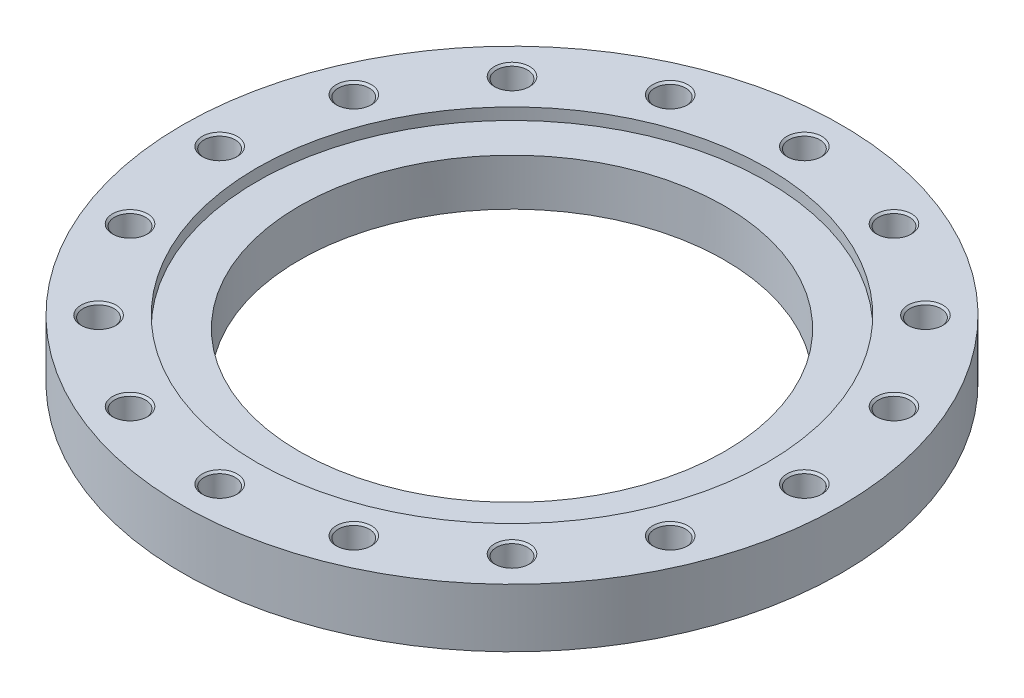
ISO-10303-21;
HEADER;
FILE_DESCRIPTION(('STEP AP214'),'2;1');
FILE_NAME('part.step','',(''),(''),'','','');
FILE_SCHEMA(('AUTOMOTIVE_DESIGN { 1 0 10303 214 1 1 1 1 }'));
ENDSEC;
DATA;
#1=APPLICATION_CONTEXT('core data for automotive mechanical design processes');
#2=APPLICATION_PROTOCOL_DEFINITION('international standard','automotive_design',2000,#1);
#3=PRODUCT_CONTEXT('',#1,'mechanical');
#4=PRODUCT('Part','Part','',(#3));
#5=PRODUCT_RELATED_PRODUCT_CATEGORY('part','',(#4));
#6=PRODUCT_DEFINITION_FORMATION('','',#4);
#7=PRODUCT_DEFINITION_CONTEXT('part definition',#1,'design');
#8=PRODUCT_DEFINITION('design','',#6,#7);
#9=PRODUCT_DEFINITION_SHAPE('','',#8);
#10=(LENGTH_UNIT() NAMED_UNIT(*) SI_UNIT(.MILLI.,.METRE.));
#11=(NAMED_UNIT(*) PLANE_ANGLE_UNIT() SI_UNIT($,.RADIAN.));
#12=(NAMED_UNIT(*) SI_UNIT($,.STERADIAN.) SOLID_ANGLE_UNIT());
#13=UNCERTAINTY_MEASURE_WITH_UNIT(LENGTH_MEASURE(1.E-05),#10,'distance_accuracy_value','');
#14=(GEOMETRIC_REPRESENTATION_CONTEXT(3) GLOBAL_UNCERTAINTY_ASSIGNED_CONTEXT((#13)) GLOBAL_UNIT_ASSIGNED_CONTEXT((#10,
#11,#12)) REPRESENTATION_CONTEXT('',''));
#15=CARTESIAN_POINT('',(0.,0.,0.));
#16=DIRECTION('',(0.,0.,1.));
#17=DIRECTION('',(1.,0.,0.));
#18=AXIS2_PLACEMENT_3D('',#15,#16,#17);
#19=CARTESIAN_POINT('',(0.,27.5,0.));
#20=DIRECTION('',(0.,-1.,0.));
#21=DIRECTION('',(1.,0.,0.));
#22=AXIS2_PLACEMENT_3D('',#19,#20,#21);
#23=CYLINDRICAL_SURFACE('',#22,310.);
#24=CARTESIAN_POINT('',(0.,0.,0.));
#25=DIRECTION('',(0.,1.,0.));
#26=DIRECTION('',(1.,0.,0.));
#27=AXIS2_PLACEMENT_3D('',#24,#25,#26);
#28=CIRCLE('',#27,310.);
#29=CARTESIAN_POINT('',(310.,0.,0.));
#30=VERTEX_POINT('',#29);
#31=EDGE_CURVE('E9',#30,#30,#28,.T.);
#32=ORIENTED_EDGE('',*,*,#31,.T.);
#33=EDGE_LOOP('',(#32));
#34=FACE_BOUND('',#33,.T.);
#35=CARTESIAN_POINT('',(0.,55.,0.));
#36=DIRECTION('',(0.,1.,0.));
#37=DIRECTION('',(1.,0.,0.));
#38=AXIS2_PLACEMENT_3D('',#35,#36,#37);
#39=CIRCLE('',#38,310.);
#40=CARTESIAN_POINT('',(310.,55.,0.));
#41=VERTEX_POINT('',#40);
#42=EDGE_CURVE('E65',#41,#41,#39,.T.);
#43=ORIENTED_EDGE('',*,*,#42,.F.);
#44=EDGE_LOOP('',(#43));
#45=FACE_BOUND('',#44,.T.);
#46=ADVANCED_FACE('F15',(#34,#45),#23,.T.);
#47=CARTESIAN_POINT('',(255.,0.,0.));
#48=DIRECTION('',(0.,-1.,0.));
#49=DIRECTION('',(-1.,0.,0.));
#50=AXIS2_PLACEMENT_3D('',#47,#48,#49);
#51=PLANE('',#50);
#52=CARTESIAN_POINT('',(0.,0.,0.));
#53=DIRECTION('',(0.,1.,0.));
#54=DIRECTION('',(1.,0.,0.));
#55=AXIS2_PLACEMENT_3D('',#52,#53,#54);
#56=CIRCLE('',#55,200.);
#57=CARTESIAN_POINT('',(200.,0.,0.));
#58=VERTEX_POINT('',#57);
#59=EDGE_CURVE('E23',#58,#58,#56,.T.);
#60=ORIENTED_EDGE('',*,*,#59,.T.);
#61=EDGE_LOOP('',(#60));
#62=FACE_BOUND('',#61,.T.);
#63=ORIENTED_EDGE('',*,*,#31,.F.);
#64=EDGE_LOOP('',(#63));
#65=FACE_BOUND('',#64,.T.);
#66=ADVANCED_FACE('F616',(#62,#65),#51,.T.);
#67=CARTESIAN_POINT('',(0.,27.5,0.));
#68=DIRECTION('',(0.,-1.,0.));
#69=DIRECTION('',(1.,0.,0.));
#70=AXIS2_PLACEMENT_3D('',#67,#68,#69);
#71=CYLINDRICAL_SURFACE('',#70,200.);
#72=ORIENTED_EDGE('',*,*,#59,.F.);
#73=EDGE_LOOP('',(#72));
#74=FACE_BOUND('',#73,.T.);
#75=CARTESIAN_POINT('',(0.,44.,0.));
#76=DIRECTION('',(0.,1.,0.));
#77=DIRECTION('',(1.,0.,0.));
#78=AXIS2_PLACEMENT_3D('',#75,#76,#77);
#79=CIRCLE('',#78,200.);
#80=CARTESIAN_POINT('',(-200.,44.,0.));
#81=VERTEX_POINT('',#80);
#82=EDGE_CURVE('E69',#81,#81,#79,.T.);
#83=ORIENTED_EDGE('',*,*,#82,.T.);
#84=EDGE_LOOP('',(#83));
#85=FACE_BOUND('',#84,.T.);
#86=ADVANCED_FACE('F620',(#74,#85),#71,.F.);
#87=CARTESIAN_POINT('',(255.,55.,0.));
#88=DIRECTION('',(0.,1.,0.));
#89=DIRECTION('',(1.,0.,0.));
#90=AXIS2_PLACEMENT_3D('',#87,#88,#89);
#91=PLANE('',#90);
#92=ORIENTED_EDGE('',*,*,#42,.T.);
#93=EDGE_LOOP('',(#92));
#94=FACE_BOUND('',#93,.T.);
#95=CARTESIAN_POINT('',(0.,55.,0.));
#96=DIRECTION('',(0.,-1.,0.));
#97=DIRECTION('',(1.,0.,0.));
#98=AXIS2_PLACEMENT_3D('',#95,#96,#97);
#99=CIRCLE('',#98,240.);
#100=CARTESIAN_POINT('',(-240.,55.,0.));
#101=VERTEX_POINT('',#100);
#102=EDGE_CURVE('E244',#101,#101,#99,.T.);
#103=ORIENTED_EDGE('',*,*,#102,.T.);
#104=EDGE_LOOP('',(#103));
#105=FACE_BOUND('',#104,.T.);
#106=CARTESIAN_POINT('',(275.,55.,0.));
#107=DIRECTION('',(0.,-1.,0.));
#108=DIRECTION('',(1.,0.,0.));
#109=AXIS2_PLACEMENT_3D('',#106,#107,#108);
#110=CIRCLE('',#109,16.5);
#111=CARTESIAN_POINT('',(291.5,55.,0.));
#112=VERTEX_POINT('',#111);
#113=EDGE_CURVE('E96',#112,#112,#110,.T.);
#114=ORIENTED_EDGE('',*,*,#113,.T.);
#115=EDGE_LOOP('',(#114));
#116=FACE_BOUND('',#115,.T.);
#117=CARTESIAN_POINT('',(254.066871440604,55.,-105.2379439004));
#118=DIRECTION('',(0.,-1.,0.));
#119=DIRECTION('',(0.923879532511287,0.,-0.38268343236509));
#120=AXIS2_PLACEMENT_3D('',#117,#118,#119);
#121=CIRCLE('',#120,16.5);
#122=CARTESIAN_POINT('',(269.31088372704,55.,-111.552220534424));
#123=VERTEX_POINT('',#122);
#124=EDGE_CURVE('E125',#123,#123,#121,.T.);
#125=ORIENTED_EDGE('',*,*,#124,.T.);
#126=EDGE_LOOP('',(#125));
#127=FACE_BOUND('',#126,.T.);
#128=CARTESIAN_POINT('',(194.4543648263,55.,-194.4543648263));
#129=DIRECTION('',(0.,-1.,0.));
#130=DIRECTION('',(0.707106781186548,0.,-0.707106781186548));
#131=AXIS2_PLACEMENT_3D('',#128,#129,#130);
#132=CIRCLE('',#131,16.5);
#133=CARTESIAN_POINT('',(206.121626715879,55.,-206.121626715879));
#134=VERTEX_POINT('',#133);
#135=EDGE_CURVE('E111',#134,#134,#132,.T.);
#136=ORIENTED_EDGE('',*,*,#135,.T.);
#137=EDGE_LOOP('',(#136));
#138=FACE_BOUND('',#137,.T.);
#139=CARTESIAN_POINT('',(105.2379439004,55.,-254.066871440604));
#140=DIRECTION('',(0.,-1.,0.));
#141=DIRECTION('',(0.38268343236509,0.,-0.923879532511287));
#142=AXIS2_PLACEMENT_3D('',#139,#140,#141);
#143=CIRCLE('',#142,16.5);
#144=CARTESIAN_POINT('',(111.552220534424,55.,-269.31088372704));
#145=VERTEX_POINT('',#144);
#146=EDGE_CURVE('E92',#145,#145,#143,.T.);
#147=ORIENTED_EDGE('',*,*,#146,.T.);
#148=EDGE_LOOP('',(#147));
#149=FACE_BOUND('',#148,.T.);
#150=CARTESIAN_POINT('',(0.,55.,-275.));
#151=DIRECTION('',(0.,-1.,0.));
#152=DIRECTION('',(0.,0.,-1.));
#153=AXIS2_PLACEMENT_3D('',#150,#151,#152);
#154=CIRCLE('',#153,16.5);
#155=CARTESIAN_POINT('',(0.,55.,-291.5));
#156=VERTEX_POINT('',#155);
#157=EDGE_CURVE('E78',#156,#156,#154,.T.);
#158=ORIENTED_EDGE('',*,*,#157,.T.);
#159=EDGE_LOOP('',(#158));
#160=FACE_BOUND('',#159,.T.);
#161=CARTESIAN_POINT('',(-105.2379439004,55.,-254.066871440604));
#162=DIRECTION('',(0.,-1.,0.));
#163=DIRECTION('',(-0.38268343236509,0.,-0.923879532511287));
#164=AXIS2_PLACEMENT_3D('',#161,#162,#163);
#165=CIRCLE('',#164,16.5);
#166=CARTESIAN_POINT('',(-111.552220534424,55.,-269.31088372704));
#167=VERTEX_POINT('',#166);
#168=EDGE_CURVE('E217',#167,#167,#165,.T.);
#169=ORIENTED_EDGE('',*,*,#168,.T.);
#170=EDGE_LOOP('',(#169));
#171=FACE_BOUND('',#170,.T.);
#172=CARTESIAN_POINT('',(-194.4543648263,55.,-194.4543648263));
#173=DIRECTION('',(0.,-1.,0.));
#174=DIRECTION('',(-0.707106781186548,0.,-0.707106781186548));
#175=AXIS2_PLACEMENT_3D('',#172,#173,#174);
#176=CIRCLE('',#175,16.5);
#177=CARTESIAN_POINT('',(-206.121626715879,55.,-206.121626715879));
#178=VERTEX_POINT('',#177);
#179=EDGE_CURVE('E263',#178,#178,#176,.T.);
#180=ORIENTED_EDGE('',*,*,#179,.T.);
#181=EDGE_LOOP('',(#180));
#182=FACE_BOUND('',#181,.T.);
#183=CARTESIAN_POINT('',(-254.066871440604,55.,-105.2379439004));
#184=DIRECTION('',(0.,-1.,0.));
#185=DIRECTION('',(-0.923879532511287,0.,-0.38268343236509));
#186=AXIS2_PLACEMENT_3D('',#183,#184,#185);
#187=CIRCLE('',#186,16.5);
#188=CARTESIAN_POINT('',(-269.31088372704,55.,-111.552220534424));
#189=VERTEX_POINT('',#188);
#190=EDGE_CURVE('E238',#189,#189,#187,.T.);
#191=ORIENTED_EDGE('',*,*,#190,.T.);
#192=EDGE_LOOP('',(#191));
#193=FACE_BOUND('',#192,.T.);
#194=CARTESIAN_POINT('',(-275.,55.,0.));
#195=DIRECTION('',(0.,-1.,0.));
#196=DIRECTION('',(-1.,0.,0.));
#197=AXIS2_PLACEMENT_3D('',#194,#195,#196);
#198=CIRCLE('',#197,16.5);
#199=CARTESIAN_POINT('',(-291.5,55.,0.));
#200=VERTEX_POINT('',#199);
#201=EDGE_CURVE('E218',#200,#200,#198,.T.);
#202=ORIENTED_EDGE('',*,*,#201,.T.);
#203=EDGE_LOOP('',(#202));
#204=FACE_BOUND('',#203,.T.);
#205=CARTESIAN_POINT('',(-254.066871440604,55.,105.2379439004));
#206=DIRECTION('',(0.,-1.,0.));
#207=DIRECTION('',(-0.923879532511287,0.,0.38268343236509));
#208=AXIS2_PLACEMENT_3D('',#205,#206,#207);
#209=CIRCLE('',#208,16.5);
#210=CARTESIAN_POINT('',(-269.31088372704,55.,111.552220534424));
#211=VERTEX_POINT('',#210);
#212=EDGE_CURVE('E192',#211,#211,#209,.T.);
#213=ORIENTED_EDGE('',*,*,#212,.T.);
#214=EDGE_LOOP('',(#213));
#215=FACE_BOUND('',#214,.T.);
#216=CARTESIAN_POINT('',(-194.4543648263,55.,194.4543648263));
#217=DIRECTION('',(0.,-1.,0.));
#218=DIRECTION('',(-0.707106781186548,0.,0.707106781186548));
#219=AXIS2_PLACEMENT_3D('',#216,#217,#218);
#220=CIRCLE('',#219,16.5);
#221=CARTESIAN_POINT('',(-206.121626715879,55.,206.121626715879));
#222=VERTEX_POINT('',#221);
#223=EDGE_CURVE('E174',#222,#222,#220,.T.);
#224=ORIENTED_EDGE('',*,*,#223,.T.);
#225=EDGE_LOOP('',(#224));
#226=FACE_BOUND('',#225,.T.);
#227=CARTESIAN_POINT('',(-105.2379439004,55.,254.066871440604));
#228=DIRECTION('',(0.,-1.,0.));
#229=DIRECTION('',(-0.382683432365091,0.,0.923879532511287));
#230=AXIS2_PLACEMENT_3D('',#227,#228,#229);
#231=CIRCLE('',#230,16.5);
#232=CARTESIAN_POINT('',(-111.552220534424,55.,269.31088372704));
#233=VERTEX_POINT('',#232);
#234=EDGE_CURVE('E156',#233,#233,#231,.T.);
#235=ORIENTED_EDGE('',*,*,#234,.T.);
#236=EDGE_LOOP('',(#235));
#237=FACE_BOUND('',#236,.T.);
#238=CARTESIAN_POINT('',(0.,55.,275.));
#239=DIRECTION('',(0.,-1.,0.));
#240=DIRECTION('',(0.,0.,1.));
#241=AXIS2_PLACEMENT_3D('',#238,#239,#240);
#242=CIRCLE('',#241,16.5);
#243=CARTESIAN_POINT('',(0.,55.,291.5));
#244=VERTEX_POINT('',#243);
#245=EDGE_CURVE('E322',#244,#244,#242,.T.);
#246=ORIENTED_EDGE('',*,*,#245,.T.);
#247=EDGE_LOOP('',(#246));
#248=FACE_BOUND('',#247,.T.);
#249=CARTESIAN_POINT('',(105.2379439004,55.,254.066871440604));
#250=DIRECTION('',(0.,-1.,0.));
#251=DIRECTION('',(0.38268343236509,0.,0.923879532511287));
#252=AXIS2_PLACEMENT_3D('',#249,#250,#251);
#253=CIRCLE('',#252,16.5);
#254=CARTESIAN_POINT('',(111.552220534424,55.,269.31088372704));
#255=VERTEX_POINT('',#254);
#256=EDGE_CURVE('E356',#255,#255,#253,.T.);
#257=ORIENTED_EDGE('',*,*,#256,.T.);
#258=EDGE_LOOP('',(#257));
#259=FACE_BOUND('',#258,.T.);
#260=CARTESIAN_POINT('',(194.4543648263,55.,194.4543648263));
#261=DIRECTION('',(0.,-1.,0.));
#262=DIRECTION('',(0.707106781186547,0.,0.707106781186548));
#263=AXIS2_PLACEMENT_3D('',#260,#261,#262);
#264=CIRCLE('',#263,16.5);
#265=CARTESIAN_POINT('',(206.121626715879,55.,206.121626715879));
#266=VERTEX_POINT('',#265);
#267=EDGE_CURVE('E361',#266,#266,#264,.T.);
#268=ORIENTED_EDGE('',*,*,#267,.T.);
#269=EDGE_LOOP('',(#268));
#270=FACE_BOUND('',#269,.T.);
#271=CARTESIAN_POINT('',(254.066871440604,55.,105.2379439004));
#272=DIRECTION('',(0.,-1.,0.));
#273=DIRECTION('',(0.923879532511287,0.,0.382683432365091));
#274=AXIS2_PLACEMENT_3D('',#271,#272,#273);
#275=CIRCLE('',#274,16.5);
#276=CARTESIAN_POINT('',(269.31088372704,55.,111.552220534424));
#277=VERTEX_POINT('',#276);
#278=EDGE_CURVE('E342',#277,#277,#275,.T.);
#279=ORIENTED_EDGE('',*,*,#278,.T.);
#280=EDGE_LOOP('',(#279));
#281=FACE_BOUND('',#280,.T.);
#282=ADVANCED_FACE('F66',(#94,#105,#116,#127,#138,#149,#160,#171,#182,#193,#204,#215,#226,#237,
#248,#259,#270,#281),#91,.T.);
#283=CARTESIAN_POINT('',(0.,44.,0.));
#284=DIRECTION('',(0.,-1.,0.));
#285=DIRECTION('',(-1.,0.,0.));
#286=AXIS2_PLACEMENT_3D('',#283,#284,#285);
#287=PLANE('',#286);
#288=CARTESIAN_POINT('',(0.,44.,0.));
#289=DIRECTION('',(0.,-1.,0.));
#290=DIRECTION('',(1.,0.,0.));
#291=AXIS2_PLACEMENT_3D('',#288,#289,#290);
#292=CIRCLE('',#291,240.);
#293=CARTESIAN_POINT('',(240.,44.,0.));
#294=VERTEX_POINT('',#293);
#295=EDGE_CURVE('E72',#294,#294,#292,.T.);
#296=ORIENTED_EDGE('',*,*,#295,.F.);
#297=EDGE_LOOP('',(#296));
#298=FACE_BOUND('',#297,.T.);
#299=ORIENTED_EDGE('',*,*,#82,.F.);
#300=EDGE_LOOP('',(#299));
#301=FACE_BOUND('',#300,.T.);
#302=ADVANCED_FACE('F674',(#298,#301),#287,.F.);
#303=CARTESIAN_POINT('',(0.,52.25,0.));
#304=DIRECTION('',(0.,-1.,0.));
#305=DIRECTION('',(1.,0.,0.));
#306=AXIS2_PLACEMENT_3D('',#303,#304,#305);
#307=CYLINDRICAL_SURFACE('',#306,240.);
#308=ORIENTED_EDGE('',*,*,#295,.T.);
#309=EDGE_LOOP('',(#308));
#310=FACE_BOUND('',#309,.T.);
#311=ORIENTED_EDGE('',*,*,#102,.F.);
#312=EDGE_LOOP('',(#311));
#313=FACE_BOUND('',#312,.T.);
#314=ADVANCED_FACE('F676',(#310,#313),#307,.F.);
#315=CARTESIAN_POINT('',(275.,7.78371923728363,0.));
#316=DIRECTION('',(0.,1.,0.));
#317=DIRECTION('',(1.,0.,0.));
#318=AXIS2_PLACEMENT_3D('',#315,#316,#317);
#319=CONICAL_SURFACE('',#318,7.3028125,1.0471975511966);
#320=CARTESIAN_POINT('',(275.,12.,0.));
#321=DIRECTION('',(0.,-1.,0.));
#322=DIRECTION('',(1.,0.,0.));
#323=AXIS2_PLACEMENT_3D('',#320,#321,#322);
#324=CIRCLE('',#323,14.605625);
#325=CARTESIAN_POINT('',(289.605625,12.,0.));
#326=VERTEX_POINT('',#325);
#327=EDGE_CURVE('E139',#326,#326,#324,.T.);
#328=ORIENTED_EDGE('',*,*,#327,.F.);
#329=EDGE_LOOP('',(#328));
#330=FACE_BOUND('',#329,.T.);
#331=CARTESIAN_POINT('',(275.,3.56743847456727,0.));
#332=VERTEX_POINT('',#331);
#333=VERTEX_LOOP('',#332);
#334=FACE_BOUND('',#333,.T.);
#335=ADVANCED_FACE('F721',(#330,#334),#319,.F.);
#336=CARTESIAN_POINT('',(275.,16.5528125,0.));
#337=DIRECTION('',(0.,1.,0.));
#338=DIRECTION('',(1.,0.,0.));
#339=AXIS2_PLACEMENT_3D('',#336,#337,#338);
#340=CYLINDRICAL_SURFACE('',#339,14.605625);
#341=CARTESIAN_POINT('',(275.,21.105625,0.));
#342=DIRECTION('',(0.,-1.,0.));
#343=DIRECTION('',(1.,0.,0.));
#344=AXIS2_PLACEMENT_3D('',#341,#342,#343);
#345=CIRCLE('',#344,14.605625);
#346=CARTESIAN_POINT('',(289.605625,21.105625,0.));
#347=VERTEX_POINT('',#346);
#348=EDGE_CURVE('E136',#347,#347,#345,.T.);
#349=ORIENTED_EDGE('',*,*,#348,.F.);
#350=EDGE_LOOP('',(#349));
#351=FACE_BOUND('',#350,.T.);
#352=ORIENTED_EDGE('',*,*,#327,.T.);
#353=EDGE_LOOP('',(#352));
#354=FACE_BOUND('',#353,.T.);
#355=ADVANCED_FACE('F692',(#351,#354),#340,.F.);
#356=CARTESIAN_POINT('',(275.,22.0528125,0.));
#357=DIRECTION('',(0.,1.,0.));
#358=DIRECTION('',(1.,0.,0.));
#359=AXIS2_PLACEMENT_3D('',#356,#357,#358);
#360=CONICAL_SURFACE('',#359,15.5528125,0.785398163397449);
#361=CARTESIAN_POINT('',(275.,23.,0.));
#362=DIRECTION('',(0.,-1.,0.));
#363=DIRECTION('',(1.,0.,0.));
#364=AXIS2_PLACEMENT_3D('',#361,#362,#363);
#365=CIRCLE('',#364,16.5);
#366=CARTESIAN_POINT('',(291.5,23.,0.));
#367=VERTEX_POINT('',#366);
#368=EDGE_CURVE('E135',#367,#367,#365,.T.);
#369=ORIENTED_EDGE('',*,*,#368,.F.);
#370=EDGE_LOOP('',(#369));
#371=FACE_BOUND('',#370,.T.);
#372=ORIENTED_EDGE('',*,*,#348,.T.);
#373=EDGE_LOOP('',(#372));
#374=FACE_BOUND('',#373,.T.);
#375=ADVANCED_FACE('F659',(#371,#374),#360,.F.);
#376=CARTESIAN_POINT('',(290.5528125,23.,0.));
#377=DIRECTION('',(0.,1.,0.));
#378=DIRECTION('',(-1.,0.,0.));
#379=AXIS2_PLACEMENT_3D('',#376,#377,#378);
#380=PLANE('',#379);
#381=CARTESIAN_POINT('',(275.,23.,0.));
#382=DIRECTION('',(0.,-1.,0.));
#383=DIRECTION('',(1.,0.,0.));
#384=AXIS2_PLACEMENT_3D('',#381,#382,#383);
#385=CIRCLE('',#384,14.605625);
#386=CARTESIAN_POINT('',(289.605625,23.,0.));
#387=VERTEX_POINT('',#386);
#388=EDGE_CURVE('E99',#387,#387,#385,.T.);
#389=ORIENTED_EDGE('',*,*,#388,.F.);
#390=EDGE_LOOP('',(#389));
#391=FACE_BOUND('',#390,.T.);
#392=ORIENTED_EDGE('',*,*,#368,.T.);
#393=EDGE_LOOP('',(#392));
#394=FACE_BOUND('',#393,.T.);
#395=ADVANCED_FACE('F656',(#391,#394),#380,.F.);
#396=CARTESIAN_POINT('',(275.,38.0528125,0.));
#397=DIRECTION('',(0.,1.,0.));
#398=DIRECTION('',(1.,0.,0.));
#399=AXIS2_PLACEMENT_3D('',#396,#397,#398);
#400=CYLINDRICAL_SURFACE('',#399,14.605625);
#401=CARTESIAN_POINT('',(275.,53.105625,0.));
#402=DIRECTION('',(0.,-1.,0.));
#403=DIRECTION('',(1.,0.,0.));
#404=AXIS2_PLACEMENT_3D('',#401,#402,#403);
#405=CIRCLE('',#404,14.605625);
#406=CARTESIAN_POINT('',(289.605625,53.105625,0.));
#407=VERTEX_POINT('',#406);
#408=EDGE_CURVE('E100',#407,#407,#405,.T.);
#409=ORIENTED_EDGE('',*,*,#408,.F.);
#410=EDGE_LOOP('',(#409));
#411=FACE_BOUND('',#410,.T.);
#412=ORIENTED_EDGE('',*,*,#388,.T.);
#413=EDGE_LOOP('',(#412));
#414=FACE_BOUND('',#413,.T.);
#415=ADVANCED_FACE('F611',(#411,#414),#400,.F.);
#416=CARTESIAN_POINT('',(275.,54.0528125,0.));
#417=DIRECTION('',(0.,1.,0.));
#418=DIRECTION('',(1.,0.,0.));
#419=AXIS2_PLACEMENT_3D('',#416,#417,#418);
#420=CONICAL_SURFACE('',#419,15.5528125,0.785398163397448);
#421=ORIENTED_EDGE('',*,*,#113,.F.);
#422=EDGE_LOOP('',(#421));
#423=FACE_BOUND('',#422,.T.);
#424=ORIENTED_EDGE('',*,*,#408,.T.);
#425=EDGE_LOOP('',(#424));
#426=FACE_BOUND('',#425,.T.);
#427=ADVANCED_FACE('F605',(#423,#426),#420,.F.);
#428=CARTESIAN_POINT('',(254.066871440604,7.78371923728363,-105.2379439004));
#429=DIRECTION('',(0.,1.,0.));
#430=DIRECTION('',(0.923879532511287,0.,-0.38268343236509));
#431=AXIS2_PLACEMENT_3D('',#428,#429,#430);
#432=CONICAL_SURFACE('',#431,7.3028125,1.0471975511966);
#433=CARTESIAN_POINT('',(254.066871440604,12.,-105.2379439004));
#434=DIRECTION('',(0.,-1.,0.));
#435=DIRECTION('',(0.923879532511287,0.,-0.38268343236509));
#436=AXIS2_PLACEMENT_3D('',#433,#434,#435);
#437=CIRCLE('',#436,14.605625);
#438=CARTESIAN_POINT('',(267.560709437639,12.,-110.827274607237));
#439=VERTEX_POINT('',#438);
#440=EDGE_CURVE('E132',#439,#439,#437,.T.);
#441=ORIENTED_EDGE('',*,*,#440,.F.);
#442=EDGE_LOOP('',(#441));
#443=FACE_BOUND('',#442,.T.);
#444=CARTESIAN_POINT('',(254.066871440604,3.56743847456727,-105.2379439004));
#445=VERTEX_POINT('',#444);
#446=VERTEX_LOOP('',#445);
#447=FACE_BOUND('',#446,.T.);
#448=ADVANCED_FACE('F599',(#443,#447),#432,.F.);
#449=CARTESIAN_POINT('',(254.066871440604,16.5528125,-105.2379439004));
#450=DIRECTION('',(0.,1.,0.));
#451=DIRECTION('',(0.923879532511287,0.,-0.38268343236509));
#452=AXIS2_PLACEMENT_3D('',#449,#450,#451);
#453=CYLINDRICAL_SURFACE('',#452,14.605625);
#454=CARTESIAN_POINT('',(254.066871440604,21.105625,-105.2379439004));
#455=DIRECTION('',(0.,-1.,0.));
#456=DIRECTION('',(0.923879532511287,0.,-0.38268343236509));
#457=AXIS2_PLACEMENT_3D('',#454,#455,#456);
#458=CIRCLE('',#457,14.605625);
#459=CARTESIAN_POINT('',(267.560709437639,21.105625,-110.827274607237));
#460=VERTEX_POINT('',#459);
#461=EDGE_CURVE('E130',#460,#460,#458,.T.);
#462=ORIENTED_EDGE('',*,*,#461,.F.);
#463=EDGE_LOOP('',(#462));
#464=FACE_BOUND('',#463,.T.);
#465=ORIENTED_EDGE('',*,*,#440,.T.);
#466=EDGE_LOOP('',(#465));
#467=FACE_BOUND('',#466,.T.);
#468=ADVANCED_FACE('F593',(#464,#467),#453,.F.);
#469=CARTESIAN_POINT('',(254.066871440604,22.0528125,-105.2379439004));
#470=DIRECTION('',(0.,1.,0.));
#471=DIRECTION('',(0.923879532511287,0.,-0.38268343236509));
#472=AXIS2_PLACEMENT_3D('',#469,#470,#471);
#473=CONICAL_SURFACE('',#472,15.5528125,0.785398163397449);
#474=CARTESIAN_POINT('',(254.066871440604,23.,-105.2379439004));
#475=DIRECTION('',(0.,-1.,0.));
#476=DIRECTION('',(0.923879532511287,0.,-0.38268343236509));
#477=AXIS2_PLACEMENT_3D('',#474,#475,#476);
#478=CIRCLE('',#477,16.5);
#479=CARTESIAN_POINT('',(269.31088372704,23.,-111.552220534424));
#480=VERTEX_POINT('',#479);
#481=EDGE_CURVE('E128',#480,#480,#478,.T.);
#482=ORIENTED_EDGE('',*,*,#481,.F.);
#483=EDGE_LOOP('',(#482));
#484=FACE_BOUND('',#483,.T.);
#485=ORIENTED_EDGE('',*,*,#461,.T.);
#486=EDGE_LOOP('',(#485));
#487=FACE_BOUND('',#486,.T.);
#488=ADVANCED_FACE('F587',(#484,#487),#473,.F.);
#489=CARTESIAN_POINT('',(268.435796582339,23.,-111.18974757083));
#490=DIRECTION('',(0.,1.,0.));
#491=DIRECTION('',(-0.923879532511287,0.,0.38268343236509));
#492=AXIS2_PLACEMENT_3D('',#489,#490,#491);
#493=PLANE('',#492);
#494=CARTESIAN_POINT('',(254.066871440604,23.,-105.2379439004));
#495=DIRECTION('',(0.,-1.,0.));
#496=DIRECTION('',(0.923879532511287,0.,-0.38268343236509));
#497=AXIS2_PLACEMENT_3D('',#494,#495,#496);
#498=CIRCLE('',#497,14.605625);
#499=CARTESIAN_POINT('',(267.560709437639,23.,-110.827274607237));
#500=VERTEX_POINT('',#499);
#501=EDGE_CURVE('E126',#500,#500,#498,.T.);
#502=ORIENTED_EDGE('',*,*,#501,.F.);
#503=EDGE_LOOP('',(#502));
#504=FACE_BOUND('',#503,.T.);
#505=ORIENTED_EDGE('',*,*,#481,.T.);
#506=EDGE_LOOP('',(#505));
#507=FACE_BOUND('',#506,.T.);
#508=ADVANCED_FACE('F581',(#504,#507),#493,.F.);
#509=CARTESIAN_POINT('',(254.066871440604,38.0528125,-105.2379439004));
#510=DIRECTION('',(0.,1.,0.));
#511=DIRECTION('',(0.923879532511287,0.,-0.38268343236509));
#512=AXIS2_PLACEMENT_3D('',#509,#510,#511);
#513=CYLINDRICAL_SURFACE('',#512,14.605625);
#514=CARTESIAN_POINT('',(254.066871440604,53.105625,-105.2379439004));
#515=DIRECTION('',(0.,-1.,0.));
#516=DIRECTION('',(0.923879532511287,0.,-0.38268343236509));
#517=AXIS2_PLACEMENT_3D('',#514,#515,#516);
#518=CIRCLE('',#517,14.605625);
#519=CARTESIAN_POINT('',(267.560709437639,53.105625,-110.827274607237));
#520=VERTEX_POINT('',#519);
#521=EDGE_CURVE('E121',#520,#520,#518,.T.);
#522=ORIENTED_EDGE('',*,*,#521,.F.);
#523=EDGE_LOOP('',(#522));
#524=FACE_BOUND('',#523,.T.);
#525=ORIENTED_EDGE('',*,*,#501,.T.);
#526=EDGE_LOOP('',(#525));
#527=FACE_BOUND('',#526,.T.);
#528=ADVANCED_FACE('F578',(#524,#527),#513,.F.);
#529=CARTESIAN_POINT('',(254.066871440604,54.0528125,-105.2379439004));
#530=DIRECTION('',(0.,1.,0.));
#531=DIRECTION('',(0.923879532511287,0.,-0.38268343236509));
#532=AXIS2_PLACEMENT_3D('',#529,#530,#531);
#533=CONICAL_SURFACE('',#532,15.5528125,0.785398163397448);
#534=ORIENTED_EDGE('',*,*,#124,.F.);
#535=EDGE_LOOP('',(#534));
#536=FACE_BOUND('',#535,.T.);
#537=ORIENTED_EDGE('',*,*,#521,.T.);
#538=EDGE_LOOP('',(#537));
#539=FACE_BOUND('',#538,.T.);
#540=ADVANCED_FACE('F576',(#536,#539),#533,.F.);
#541=CARTESIAN_POINT('',(194.4543648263,7.78371923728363,-194.4543648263));
#542=DIRECTION('',(0.,1.,0.));
#543=DIRECTION('',(0.707106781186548,0.,-0.707106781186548));
#544=AXIS2_PLACEMENT_3D('',#541,#542,#543);
#545=CONICAL_SURFACE('',#544,7.3028125,1.0471975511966);
#546=CARTESIAN_POINT('',(194.4543648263,12.,-194.4543648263));
#547=DIRECTION('',(0.,-1.,0.));
#548=DIRECTION('',(0.707106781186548,0.,-0.707106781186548));
#549=AXIS2_PLACEMENT_3D('',#546,#547,#548);
#550=CIRCLE('',#549,14.605625);
#551=CARTESIAN_POINT('',(204.782101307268,12.,-204.782101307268));
#552=VERTEX_POINT('',#551);
#553=EDGE_CURVE('E118',#552,#552,#550,.T.);
#554=ORIENTED_EDGE('',*,*,#553,.F.);
#555=EDGE_LOOP('',(#554));
#556=FACE_BOUND('',#555,.T.);
#557=CARTESIAN_POINT('',(194.4543648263,3.56743847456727,-194.4543648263));
#558=VERTEX_POINT('',#557);
#559=VERTEX_LOOP('',#558);
#560=FACE_BOUND('',#559,.T.);
#561=ADVANCED_FACE('F636',(#556,#560),#545,.F.);
#562=CARTESIAN_POINT('',(194.4543648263,16.5528125,-194.4543648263));
#563=DIRECTION('',(0.,1.,0.));
#564=DIRECTION('',(0.707106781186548,0.,-0.707106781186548));
#565=AXIS2_PLACEMENT_3D('',#562,#563,#564);
#566=CYLINDRICAL_SURFACE('',#565,14.605625);
#567=CARTESIAN_POINT('',(194.4543648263,21.105625,-194.4543648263));
#568=DIRECTION('',(0.,-1.,0.));
#569=DIRECTION('',(0.707106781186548,0.,-0.707106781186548));
#570=AXIS2_PLACEMENT_3D('',#567,#568,#569);
#571=CIRCLE('',#570,14.605625);
#572=CARTESIAN_POINT('',(204.782101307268,21.105625,-204.782101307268));
#573=VERTEX_POINT('',#572);
#574=EDGE_CURVE('E122',#573,#573,#571,.T.);
#575=ORIENTED_EDGE('',*,*,#574,.F.);
#576=EDGE_LOOP('',(#575));
#577=FACE_BOUND('',#576,.T.);
#578=ORIENTED_EDGE('',*,*,#553,.T.);
#579=EDGE_LOOP('',(#578));
#580=FACE_BOUND('',#579,.T.);
#581=ADVANCED_FACE('F632',(#577,#580),#566,.F.);
#582=CARTESIAN_POINT('',(194.4543648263,22.0528125,-194.4543648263));
#583=DIRECTION('',(0.,1.,0.));
#584=DIRECTION('',(0.707106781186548,0.,-0.707106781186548));
#585=AXIS2_PLACEMENT_3D('',#582,#583,#584);
#586=CONICAL_SURFACE('',#585,15.5528125,0.785398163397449);
#587=CARTESIAN_POINT('',(194.4543648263,23.,-194.4543648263));
#588=DIRECTION('',(0.,-1.,0.));
#589=DIRECTION('',(0.707106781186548,0.,-0.707106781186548));
#590=AXIS2_PLACEMENT_3D('',#587,#588,#589);
#591=CIRCLE('',#590,16.5);
#592=CARTESIAN_POINT('',(206.121626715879,23.,-206.121626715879));
#593=VERTEX_POINT('',#592);
#594=EDGE_CURVE('E117',#593,#593,#591,.T.);
#595=ORIENTED_EDGE('',*,*,#594,.F.);
#596=EDGE_LOOP('',(#595));
#597=FACE_BOUND('',#596,.T.);
#598=ORIENTED_EDGE('',*,*,#574,.T.);
#599=EDGE_LOOP('',(#598));
#600=FACE_BOUND('',#599,.T.);
#601=ADVANCED_FACE('F635',(#597,#600),#586,.F.);
#602=CARTESIAN_POINT('',(205.451864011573,23.,-205.451864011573));
#603=DIRECTION('',(0.,1.,0.));
#604=DIRECTION('',(-0.707106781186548,0.,0.707106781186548));
#605=AXIS2_PLACEMENT_3D('',#602,#603,#604);
#606=PLANE('',#605);
#607=CARTESIAN_POINT('',(194.4543648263,23.,-194.4543648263));
#608=DIRECTION('',(0.,-1.,0.));
#609=DIRECTION('',(0.707106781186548,0.,-0.707106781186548));
#610=AXIS2_PLACEMENT_3D('',#607,#608,#609);
#611=CIRCLE('',#610,14.605625);
#612=CARTESIAN_POINT('',(204.782101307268,23.,-204.782101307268));
#613=VERTEX_POINT('',#612);
#614=EDGE_CURVE('E114',#613,#613,#611,.T.);
#615=ORIENTED_EDGE('',*,*,#614,.F.);
#616=EDGE_LOOP('',(#615));
#617=FACE_BOUND('',#616,.T.);
#618=ORIENTED_EDGE('',*,*,#594,.T.);
#619=EDGE_LOOP('',(#618));
#620=FACE_BOUND('',#619,.T.);
#621=ADVANCED_FACE('F856',(#617,#620),#606,.F.);
#622=CARTESIAN_POINT('',(194.4543648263,38.0528125,-194.4543648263));
#623=DIRECTION('',(0.,1.,0.));
#624=DIRECTION('',(0.707106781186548,0.,-0.707106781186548));
#625=AXIS2_PLACEMENT_3D('',#622,#623,#624);
#626=CYLINDRICAL_SURFACE('',#625,14.605625);
#627=CARTESIAN_POINT('',(194.4543648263,53.105625,-194.4543648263));
#628=DIRECTION('',(0.,-1.,0.));
#629=DIRECTION('',(0.707106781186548,0.,-0.707106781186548));
#630=AXIS2_PLACEMENT_3D('',#627,#628,#629);
#631=CIRCLE('',#630,14.605625);
#632=CARTESIAN_POINT('',(204.782101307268,53.105625,-204.782101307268));
#633=VERTEX_POINT('',#632);
#634=EDGE_CURVE('E108',#633,#633,#631,.T.);
#635=ORIENTED_EDGE('',*,*,#634,.F.);
#636=EDGE_LOOP('',(#635));
#637=FACE_BOUND('',#636,.T.);
#638=ORIENTED_EDGE('',*,*,#614,.T.);
#639=EDGE_LOOP('',(#638));
#640=FACE_BOUND('',#639,.T.);
#641=ADVANCED_FACE('F852',(#637,#640),#626,.F.);
#642=CARTESIAN_POINT('',(194.4543648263,54.0528125,-194.4543648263));
#643=DIRECTION('',(0.,1.,0.));
#644=DIRECTION('',(0.707106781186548,0.,-0.707106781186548));
#645=AXIS2_PLACEMENT_3D('',#642,#643,#644);
#646=CONICAL_SURFACE('',#645,15.5528125,0.785398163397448);
#647=ORIENTED_EDGE('',*,*,#135,.F.);
#648=EDGE_LOOP('',(#647));
#649=FACE_BOUND('',#648,.T.);
#650=ORIENTED_EDGE('',*,*,#634,.T.);
#651=EDGE_LOOP('',(#650));
#652=FACE_BOUND('',#651,.T.);
#653=ADVANCED_FACE('F848',(#649,#652),#646,.F.);
#654=CARTESIAN_POINT('',(105.2379439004,7.78371923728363,-254.066871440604));
#655=DIRECTION('',(0.,1.,0.));
#656=DIRECTION('',(0.38268343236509,0.,-0.923879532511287));
#657=AXIS2_PLACEMENT_3D('',#654,#655,#656);
#658=CONICAL_SURFACE('',#657,7.3028125,1.0471975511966);
#659=CARTESIAN_POINT('',(105.2379439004,12.,-254.066871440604));
#660=DIRECTION('',(0.,-1.,0.));
#661=DIRECTION('',(0.38268343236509,0.,-0.923879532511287));
#662=AXIS2_PLACEMENT_3D('',#659,#660,#661);
#663=CIRCLE('',#662,14.605625);
#664=CARTESIAN_POINT('',(110.827274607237,12.,-267.560709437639));
#665=VERTEX_POINT('',#664);
#666=EDGE_CURVE('E107',#665,#665,#663,.T.);
#667=ORIENTED_EDGE('',*,*,#666,.F.);
#668=EDGE_LOOP('',(#667));
#669=FACE_BOUND('',#668,.T.);
#670=CARTESIAN_POINT('',(105.2379439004,3.56743847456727,-254.066871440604));
#671=VERTEX_POINT('',#670);
#672=VERTEX_LOOP('',#671);
#673=FACE_BOUND('',#672,.T.);
#674=ADVANCED_FACE('F844',(#669,#673),#658,.F.);
#675=CARTESIAN_POINT('',(105.2379439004,16.5528125,-254.066871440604));
#676=DIRECTION('',(0.,1.,0.));
#677=DIRECTION('',(0.38268343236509,0.,-0.923879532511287));
#678=AXIS2_PLACEMENT_3D('',#675,#676,#677);
#679=CYLINDRICAL_SURFACE('',#678,14.605625);
#680=CARTESIAN_POINT('',(105.2379439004,21.105625,-254.066871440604));
#681=DIRECTION('',(0.,-1.,0.));
#682=DIRECTION('',(0.38268343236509,0.,-0.923879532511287));
#683=AXIS2_PLACEMENT_3D('',#680,#681,#682);
#684=CIRCLE('',#683,14.605625);
#685=CARTESIAN_POINT('',(110.827274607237,21.105625,-267.560709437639));
#686=VERTEX_POINT('',#685);
#687=EDGE_CURVE('E104',#686,#686,#684,.T.);
#688=ORIENTED_EDGE('',*,*,#687,.F.);
#689=EDGE_LOOP('',(#688));
#690=FACE_BOUND('',#689,.T.);
#691=ORIENTED_EDGE('',*,*,#666,.T.);
#692=EDGE_LOOP('',(#691));
#693=FACE_BOUND('',#692,.T.);
#694=ADVANCED_FACE('F841',(#690,#693),#679,.F.);
#695=CARTESIAN_POINT('',(105.2379439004,22.0528125,-254.066871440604));
#696=DIRECTION('',(0.,1.,0.));
#697=DIRECTION('',(0.38268343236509,0.,-0.923879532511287));
#698=AXIS2_PLACEMENT_3D('',#695,#696,#697);
#699=CONICAL_SURFACE('',#698,15.5528125,0.785398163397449);
#700=CARTESIAN_POINT('',(105.2379439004,23.,-254.066871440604));
#701=DIRECTION('',(0.,-1.,0.));
#702=DIRECTION('',(0.38268343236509,0.,-0.923879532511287));
#703=AXIS2_PLACEMENT_3D('',#700,#701,#702);
#704=CIRCLE('',#703,16.5);
#705=CARTESIAN_POINT('',(111.552220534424,23.,-269.31088372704));
#706=VERTEX_POINT('',#705);
#707=EDGE_CURVE('E103',#706,#706,#704,.T.);
#708=ORIENTED_EDGE('',*,*,#707,.F.);
#709=EDGE_LOOP('',(#708));
#710=FACE_BOUND('',#709,.T.);
#711=ORIENTED_EDGE('',*,*,#687,.T.);
#712=EDGE_LOOP('',(#711));
#713=FACE_BOUND('',#712,.T.);
#714=ADVANCED_FACE('F839',(#710,#713),#699,.F.);
#715=CARTESIAN_POINT('',(111.18974757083,23.,-268.435796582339));
#716=DIRECTION('',(0.,1.,0.));
#717=DIRECTION('',(-0.38268343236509,0.,0.923879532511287));
#718=AXIS2_PLACEMENT_3D('',#715,#716,#717);
#719=PLANE('',#718);
#720=CARTESIAN_POINT('',(105.2379439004,23.,-254.066871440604));
#721=DIRECTION('',(0.,-1.,0.));
#722=DIRECTION('',(0.38268343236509,0.,-0.923879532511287));
#723=AXIS2_PLACEMENT_3D('',#720,#721,#722);
#724=CIRCLE('',#723,14.605625);
#725=CARTESIAN_POINT('',(110.827274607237,23.,-267.560709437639));
#726=VERTEX_POINT('',#725);
#727=EDGE_CURVE('E95',#726,#726,#724,.T.);
#728=ORIENTED_EDGE('',*,*,#727,.F.);
#729=EDGE_LOOP('',(#728));
#730=FACE_BOUND('',#729,.T.);
#731=ORIENTED_EDGE('',*,*,#707,.T.);
#732=EDGE_LOOP('',(#731));
#733=FACE_BOUND('',#732,.T.);
#734=ADVANCED_FACE('F836',(#730,#733),#719,.F.);
#735=CARTESIAN_POINT('',(105.2379439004,38.0528125,-254.066871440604));
#736=DIRECTION('',(0.,1.,0.));
#737=DIRECTION('',(0.38268343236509,0.,-0.923879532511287));
#738=AXIS2_PLACEMENT_3D('',#735,#736,#737);
#739=CYLINDRICAL_SURFACE('',#738,14.605625);
#740=CARTESIAN_POINT('',(105.2379439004,53.105625,-254.066871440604));
#741=DIRECTION('',(0.,-1.,0.));
#742=DIRECTION('',(0.38268343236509,0.,-0.923879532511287));
#743=AXIS2_PLACEMENT_3D('',#740,#741,#742);
#744=CIRCLE('',#743,14.605625);
#745=CARTESIAN_POINT('',(110.827274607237,53.105625,-267.560709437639));
#746=VERTEX_POINT('',#745);
#747=EDGE_CURVE('E91',#746,#746,#744,.T.);
#748=ORIENTED_EDGE('',*,*,#747,.F.);
#749=EDGE_LOOP('',(#748));
#750=FACE_BOUND('',#749,.T.);
#751=ORIENTED_EDGE('',*,*,#727,.T.);
#752=EDGE_LOOP('',(#751));
#753=FACE_BOUND('',#752,.T.);
#754=ADVANCED_FACE('F834',(#750,#753),#739,.F.);
#755=CARTESIAN_POINT('',(105.2379439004,54.0528125,-254.066871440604));
#756=DIRECTION('',(0.,1.,0.));
#757=DIRECTION('',(0.38268343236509,0.,-0.923879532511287));
#758=AXIS2_PLACEMENT_3D('',#755,#756,#757);
#759=CONICAL_SURFACE('',#758,15.5528125,0.785398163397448);
#760=ORIENTED_EDGE('',*,*,#146,.F.);
#761=EDGE_LOOP('',(#760));
#762=FACE_BOUND('',#761,.T.);
#763=ORIENTED_EDGE('',*,*,#747,.T.);
#764=EDGE_LOOP('',(#763));
#765=FACE_BOUND('',#764,.T.);
#766=ADVANCED_FACE('F830',(#762,#765),#759,.F.);
#767=CARTESIAN_POINT('',(0.,7.78371923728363,-275.));
#768=DIRECTION('',(0.,1.,0.));
#769=DIRECTION('',(0.,0.,-1.));
#770=AXIS2_PLACEMENT_3D('',#767,#768,#769);
#771=CONICAL_SURFACE('',#770,7.3028125,1.0471975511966);
#772=CARTESIAN_POINT('',(0.,12.,-275.));
#773=DIRECTION('',(0.,-1.,0.));
#774=DIRECTION('',(0.,0.,-1.));
#775=AXIS2_PLACEMENT_3D('',#772,#773,#774);
#776=CIRCLE('',#775,14.605625);
#777=CARTESIAN_POINT('',(0.,12.,-289.605625));
#778=VERTEX_POINT('',#777);
#779=EDGE_CURVE('E88',#778,#778,#776,.T.);
#780=ORIENTED_EDGE('',*,*,#779,.F.);
#781=EDGE_LOOP('',(#780));
#782=FACE_BOUND('',#781,.T.);
#783=CARTESIAN_POINT('',(0.,3.56743847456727,-275.));
#784=VERTEX_POINT('',#783);
#785=VERTEX_LOOP('',#784);
#786=FACE_BOUND('',#785,.T.);
#787=ADVANCED_FACE('F826',(#782,#786),#771,.F.);
#788=CARTESIAN_POINT('',(0.,16.5528125,-275.));
#789=DIRECTION('',(0.,1.,0.));
#790=DIRECTION('',(0.,0.,-1.));
#791=AXIS2_PLACEMENT_3D('',#788,#789,#790);
#792=CYLINDRICAL_SURFACE('',#791,14.605625);
#793=CARTESIAN_POINT('',(0.,21.105625,-275.));
#794=DIRECTION('',(0.,-1.,0.));
#795=DIRECTION('',(0.,0.,-1.));
#796=AXIS2_PLACEMENT_3D('',#793,#794,#795);
#797=CIRCLE('',#796,14.605625);
#798=CARTESIAN_POINT('',(0.,21.105625,-289.605625));
#799=VERTEX_POINT('',#798);
#800=EDGE_CURVE('E85',#799,#799,#797,.T.);
#801=ORIENTED_EDGE('',*,*,#800,.F.);
#802=EDGE_LOOP('',(#801));
#803=FACE_BOUND('',#802,.T.);
#804=ORIENTED_EDGE('',*,*,#779,.T.);
#805=EDGE_LOOP('',(#804));
#806=FACE_BOUND('',#805,.T.);
#807=ADVANCED_FACE('F822',(#803,#806),#792,.F.);
#808=CARTESIAN_POINT('',(0.,22.0528125,-275.));
#809=DIRECTION('',(0.,1.,0.));
#810=DIRECTION('',(0.,0.,-1.));
#811=AXIS2_PLACEMENT_3D('',#808,#809,#810);
#812=CONICAL_SURFACE('',#811,15.5528125,0.785398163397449);
#813=CARTESIAN_POINT('',(0.,23.,-275.));
#814=DIRECTION('',(0.,-1.,0.));
#815=DIRECTION('',(0.,0.,-1.));
#816=AXIS2_PLACEMENT_3D('',#813,#814,#815);
#817=CIRCLE('',#816,16.5);
#818=CARTESIAN_POINT('',(0.,23.,-291.5));
#819=VERTEX_POINT('',#818);
#820=EDGE_CURVE('E82',#819,#819,#817,.T.);
#821=ORIENTED_EDGE('',*,*,#820,.F.);
#822=EDGE_LOOP('',(#821));
#823=FACE_BOUND('',#822,.T.);
#824=ORIENTED_EDGE('',*,*,#800,.T.);
#825=EDGE_LOOP('',(#824));
#826=FACE_BOUND('',#825,.T.);
#827=ADVANCED_FACE('F818',(#823,#826),#812,.F.);
#828=CARTESIAN_POINT('',(0.,23.,-290.5528125));
#829=DIRECTION('',(0.,1.,0.));
#830=DIRECTION('',(0.,0.,1.));
#831=AXIS2_PLACEMENT_3D('',#828,#829,#830);
#832=PLANE('',#831);
#833=CARTESIAN_POINT('',(0.,23.,-275.));
#834=DIRECTION('',(0.,-1.,0.));
#835=DIRECTION('',(0.,0.,-1.));
#836=AXIS2_PLACEMENT_3D('',#833,#834,#835);
#837=CIRCLE('',#836,14.605625);
#838=CARTESIAN_POINT('',(0.,23.,-289.605625));
#839=VERTEX_POINT('',#838);
#840=EDGE_CURVE('E81',#839,#839,#837,.T.);
#841=ORIENTED_EDGE('',*,*,#840,.F.);
#842=EDGE_LOOP('',(#841));
#843=FACE_BOUND('',#842,.T.);
#844=ORIENTED_EDGE('',*,*,#820,.T.);
#845=EDGE_LOOP('',(#844));
#846=FACE_BOUND('',#845,.T.);
#847=ADVANCED_FACE('F814',(#843,#846),#832,.F.);
#848=CARTESIAN_POINT('',(0.,38.0528125,-275.));
#849=DIRECTION('',(0.,1.,0.));
#850=DIRECTION('',(0.,0.,-1.));
#851=AXIS2_PLACEMENT_3D('',#848,#849,#850);
#852=CYLINDRICAL_SURFACE('',#851,14.605625);
#853=CARTESIAN_POINT('',(0.,53.105625,-275.));
#854=DIRECTION('',(0.,-1.,0.));
#855=DIRECTION('',(0.,0.,-1.));
#856=AXIS2_PLACEMENT_3D('',#853,#854,#855);
#857=CIRCLE('',#856,14.605625);
#858=CARTESIAN_POINT('',(0.,53.105625,-289.605625));
#859=VERTEX_POINT('',#858);
#860=EDGE_CURVE('E76',#859,#859,#857,.T.);
#861=ORIENTED_EDGE('',*,*,#860,.F.);
#862=EDGE_LOOP('',(#861));
#863=FACE_BOUND('',#862,.T.);
#864=ORIENTED_EDGE('',*,*,#840,.T.);
#865=EDGE_LOOP('',(#864));
#866=FACE_BOUND('',#865,.T.);
#867=ADVANCED_FACE('F810',(#863,#866),#852,.F.);
#868=CARTESIAN_POINT('',(0.,54.0528125,-275.));
#869=DIRECTION('',(0.,1.,0.));
#870=DIRECTION('',(0.,0.,-1.));
#871=AXIS2_PLACEMENT_3D('',#868,#869,#870);
#872=CONICAL_SURFACE('',#871,15.5528125,0.785398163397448);
#873=ORIENTED_EDGE('',*,*,#157,.F.);
#874=EDGE_LOOP('',(#873));
#875=FACE_BOUND('',#874,.T.);
#876=ORIENTED_EDGE('',*,*,#860,.T.);
#877=EDGE_LOOP('',(#876));
#878=FACE_BOUND('',#877,.T.);
#879=ADVANCED_FACE('F807',(#875,#878),#872,.F.);
#880=CARTESIAN_POINT('',(-105.2379439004,7.78371923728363,-254.066871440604));
#881=DIRECTION('',(0.,1.,0.));
#882=DIRECTION('',(-0.38268343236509,0.,-0.923879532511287));
#883=AXIS2_PLACEMENT_3D('',#880,#881,#882);
#884=CONICAL_SURFACE('',#883,7.3028125,1.0471975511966);
#885=CARTESIAN_POINT('',(-105.2379439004,12.,-254.066871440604));
#886=DIRECTION('',(0.,-1.,0.));
#887=DIRECTION('',(-0.38268343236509,0.,-0.923879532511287));
#888=AXIS2_PLACEMENT_3D('',#885,#886,#887);
#889=CIRCLE('',#888,14.605625);
#890=CARTESIAN_POINT('',(-110.827274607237,12.,-267.560709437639));
#891=VERTEX_POINT('',#890);
#892=EDGE_CURVE('E225',#891,#891,#889,.T.);
#893=ORIENTED_EDGE('',*,*,#892,.F.);
#894=EDGE_LOOP('',(#893));
#895=FACE_BOUND('',#894,.T.);
#896=CARTESIAN_POINT('',(-105.2379439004,3.56743847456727,-254.066871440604));
#897=VERTEX_POINT('',#896);
#898=VERTEX_LOOP('',#897);
#899=FACE_BOUND('',#898,.T.);
#900=ADVANCED_FACE('F295',(#895,#899),#884,.F.);
#901=CARTESIAN_POINT('',(-105.2379439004,16.5528125,-254.066871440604));
#902=DIRECTION('',(0.,1.,0.));
#903=DIRECTION('',(-0.38268343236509,0.,-0.923879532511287));
#904=AXIS2_PLACEMENT_3D('',#901,#902,#903);
#905=CYLINDRICAL_SURFACE('',#904,14.605625);
#906=CARTESIAN_POINT('',(-105.2379439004,21.105625,-254.066871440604));
#907=DIRECTION('',(0.,-1.,0.));
#908=DIRECTION('',(-0.38268343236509,0.,-0.923879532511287));
#909=AXIS2_PLACEMENT_3D('',#906,#907,#908);
#910=CIRCLE('',#909,14.605625);
#911=CARTESIAN_POINT('',(-110.827274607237,21.105625,-267.560709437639));
#912=VERTEX_POINT('',#911);
#913=EDGE_CURVE('E222',#912,#912,#910,.T.);
#914=ORIENTED_EDGE('',*,*,#913,.F.);
#915=EDGE_LOOP('',(#914));
#916=FACE_BOUND('',#915,.T.);
#917=ORIENTED_EDGE('',*,*,#892,.T.);
#918=EDGE_LOOP('',(#917));
#919=FACE_BOUND('',#918,.T.);
#920=ADVANCED_FACE('F287',(#916,#919),#905,.F.);
#921=CARTESIAN_POINT('',(-105.2379439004,22.0528125,-254.066871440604));
#922=DIRECTION('',(0.,1.,0.));
#923=DIRECTION('',(-0.38268343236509,0.,-0.923879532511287));
#924=AXIS2_PLACEMENT_3D('',#921,#922,#923);
#925=CONICAL_SURFACE('',#924,15.5528125,0.785398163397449);
#926=CARTESIAN_POINT('',(-105.2379439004,23.,-254.066871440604));
#927=DIRECTION('',(0.,-1.,0.));
#928=DIRECTION('',(-0.38268343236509,0.,-0.923879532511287));
#929=AXIS2_PLACEMENT_3D('',#926,#927,#928);
#930=CIRCLE('',#929,16.5);
#931=CARTESIAN_POINT('',(-111.552220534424,23.,-269.31088372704));
#932=VERTEX_POINT('',#931);
#933=EDGE_CURVE('E216',#932,#932,#930,.T.);
#934=ORIENTED_EDGE('',*,*,#933,.F.);
#935=EDGE_LOOP('',(#934));
#936=FACE_BOUND('',#935,.T.);
#937=ORIENTED_EDGE('',*,*,#913,.T.);
#938=EDGE_LOOP('',(#937));
#939=FACE_BOUND('',#938,.T.);
#940=ADVANCED_FACE('F284',(#936,#939),#925,.F.);
#941=CARTESIAN_POINT('',(-111.18974757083,23.,-268.435796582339));
#942=DIRECTION('',(0.,1.,0.));
#943=DIRECTION('',(0.38268343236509,0.,0.923879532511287));
#944=AXIS2_PLACEMENT_3D('',#941,#942,#943);
#945=PLANE('',#944);
#946=CARTESIAN_POINT('',(-105.2379439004,23.,-254.066871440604));
#947=DIRECTION('',(0.,-1.,0.));
#948=DIRECTION('',(-0.38268343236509,0.,-0.923879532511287));
#949=AXIS2_PLACEMENT_3D('',#946,#947,#948);
#950=CIRCLE('',#949,14.605625);
#951=CARTESIAN_POINT('',(-110.827274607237,23.,-267.560709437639));
#952=VERTEX_POINT('',#951);
#953=EDGE_CURVE('E213',#952,#952,#950,.T.);
#954=ORIENTED_EDGE('',*,*,#953,.F.);
#955=EDGE_LOOP('',(#954));
#956=FACE_BOUND('',#955,.T.);
#957=ORIENTED_EDGE('',*,*,#933,.T.);
#958=EDGE_LOOP('',(#957));
#959=FACE_BOUND('',#958,.T.);
#960=ADVANCED_FACE('F279',(#956,#959),#945,.F.);
#961=CARTESIAN_POINT('',(-105.2379439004,38.0528125,-254.066871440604));
#962=DIRECTION('',(0.,1.,0.));
#963=DIRECTION('',(-0.38268343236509,0.,-0.923879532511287));
#964=AXIS2_PLACEMENT_3D('',#961,#962,#963);
#965=CYLINDRICAL_SURFACE('',#964,14.605625);
#966=CARTESIAN_POINT('',(-105.2379439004,53.105625,-254.066871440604));
#967=DIRECTION('',(0.,-1.,0.));
#968=DIRECTION('',(-0.38268343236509,0.,-0.923879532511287));
#969=AXIS2_PLACEMENT_3D('',#966,#967,#968);
#970=CIRCLE('',#969,14.605625);
#971=CARTESIAN_POINT('',(-110.827274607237,53.105625,-267.560709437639));
#972=VERTEX_POINT('',#971);
#973=EDGE_CURVE('E271',#972,#972,#970,.T.);
#974=ORIENTED_EDGE('',*,*,#973,.F.);
#975=EDGE_LOOP('',(#974));
#976=FACE_BOUND('',#975,.T.);
#977=ORIENTED_EDGE('',*,*,#953,.T.);
#978=EDGE_LOOP('',(#977));
#979=FACE_BOUND('',#978,.T.);
#980=ADVANCED_FACE('F797',(#976,#979),#965,.F.);
#981=CARTESIAN_POINT('',(-105.2379439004,54.0528125,-254.066871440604));
#982=DIRECTION('',(0.,1.,0.));
#983=DIRECTION('',(-0.38268343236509,0.,-0.923879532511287));
#984=AXIS2_PLACEMENT_3D('',#981,#982,#983);
#985=CONICAL_SURFACE('',#984,15.5528125,0.785398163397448);
#986=ORIENTED_EDGE('',*,*,#168,.F.);
#987=EDGE_LOOP('',(#986));
#988=FACE_BOUND('',#987,.T.);
#989=ORIENTED_EDGE('',*,*,#973,.T.);
#990=EDGE_LOOP('',(#989));
#991=FACE_BOUND('',#990,.T.);
#992=ADVANCED_FACE('F727',(#988,#991),#985,.F.);
#993=CARTESIAN_POINT('',(-194.4543648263,7.78371923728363,-194.4543648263));
#994=DIRECTION('',(0.,1.,0.));
#995=DIRECTION('',(-0.707106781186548,0.,-0.707106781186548));
#996=AXIS2_PLACEMENT_3D('',#993,#994,#995);
#997=CONICAL_SURFACE('',#996,7.3028125,1.0471975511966);
#998=CARTESIAN_POINT('',(-194.4543648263,12.,-194.4543648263));
#999=DIRECTION('',(0.,-1.,0.));
#1000=DIRECTION('',(-0.707106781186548,0.,-0.707106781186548));
#1001=AXIS2_PLACEMENT_3D('',#998,#999,#1000);
#1002=CIRCLE('',#1001,14.605625);
#1003=CARTESIAN_POINT('',(-204.782101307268,12.,-204.782101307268));
#1004=VERTEX_POINT('',#1003);
#1005=EDGE_CURVE('E205',#1004,#1004,#1002,.T.);
#1006=ORIENTED_EDGE('',*,*,#1005,.F.);
#1007=EDGE_LOOP('',(#1006));
#1008=FACE_BOUND('',#1007,.T.);
#1009=CARTESIAN_POINT('',(-194.4543648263,3.56743847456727,-194.4543648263));
#1010=VERTEX_POINT('',#1009);
#1011=VERTEX_LOOP('',#1010);
#1012=FACE_BOUND('',#1011,.T.);
#1013=ADVANCED_FACE('F723',(#1008,#1012),#997,.F.);
#1014=CARTESIAN_POINT('',(-194.4543648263,16.5528125,-194.4543648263));
#1015=DIRECTION('',(0.,1.,0.));
#1016=DIRECTION('',(-0.707106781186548,0.,-0.707106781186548));
#1017=AXIS2_PLACEMENT_3D('',#1014,#1015,#1016);
#1018=CYLINDRICAL_SURFACE('',#1017,14.605625);
#1019=CARTESIAN_POINT('',(-194.4543648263,21.105625,-194.4543648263));
#1020=DIRECTION('',(0.,-1.,0.));
#1021=DIRECTION('',(-0.707106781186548,0.,-0.707106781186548));
#1022=AXIS2_PLACEMENT_3D('',#1019,#1020,#1021);
#1023=CIRCLE('',#1022,14.605625);
#1024=CARTESIAN_POINT('',(-204.782101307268,21.105625,-204.782101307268));
#1025=VERTEX_POINT('',#1024);
#1026=EDGE_CURVE('E202',#1025,#1025,#1023,.T.);
#1027=ORIENTED_EDGE('',*,*,#1026,.F.);
#1028=EDGE_LOOP('',(#1027));
#1029=FACE_BOUND('',#1028,.T.);
#1030=ORIENTED_EDGE('',*,*,#1005,.T.);
#1031=EDGE_LOOP('',(#1030));
#1032=FACE_BOUND('',#1031,.T.);
#1033=ADVANCED_FACE('F726',(#1029,#1032),#1018,.F.);
#1034=CARTESIAN_POINT('',(-194.4543648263,22.0528125,-194.4543648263));
#1035=DIRECTION('',(0.,1.,0.));
#1036=DIRECTION('',(-0.707106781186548,0.,-0.707106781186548));
#1037=AXIS2_PLACEMENT_3D('',#1034,#1035,#1036);
#1038=CONICAL_SURFACE('',#1037,15.5528125,0.785398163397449);
#1039=CARTESIAN_POINT('',(-194.4543648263,23.,-194.4543648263));
#1040=DIRECTION('',(0.,-1.,0.));
#1041=DIRECTION('',(-0.707106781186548,0.,-0.707106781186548));
#1042=AXIS2_PLACEMENT_3D('',#1039,#1040,#1041);
#1043=CIRCLE('',#1042,16.5);
#1044=CARTESIAN_POINT('',(-206.121626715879,23.,-206.121626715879));
#1045=VERTEX_POINT('',#1044);
#1046=EDGE_CURVE('E206',#1045,#1045,#1043,.T.);
#1047=ORIENTED_EDGE('',*,*,#1046,.F.);
#1048=EDGE_LOOP('',(#1047));
#1049=FACE_BOUND('',#1048,.T.);
#1050=ORIENTED_EDGE('',*,*,#1026,.T.);
#1051=EDGE_LOOP('',(#1050));
#1052=FACE_BOUND('',#1051,.T.);
#1053=ADVANCED_FACE('F787',(#1049,#1052),#1038,.F.);
#1054=CARTESIAN_POINT('',(-205.451864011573,23.,-205.451864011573));
#1055=DIRECTION('',(0.,1.,0.));
#1056=DIRECTION('',(0.707106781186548,0.,0.707106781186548));
#1057=AXIS2_PLACEMENT_3D('',#1054,#1055,#1056);
#1058=PLANE('',#1057);
#1059=CARTESIAN_POINT('',(-194.4543648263,23.,-194.4543648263));
#1060=DIRECTION('',(0.,-1.,0.));
#1061=DIRECTION('',(-0.707106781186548,0.,-0.707106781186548));
#1062=AXIS2_PLACEMENT_3D('',#1059,#1060,#1061);
#1063=CIRCLE('',#1062,14.605625);
#1064=CARTESIAN_POINT('',(-204.782101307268,23.,-204.782101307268));
#1065=VERTEX_POINT('',#1064);
#1066=EDGE_CURVE('E266',#1065,#1065,#1063,.T.);
#1067=ORIENTED_EDGE('',*,*,#1066,.F.);
#1068=EDGE_LOOP('',(#1067));
#1069=FACE_BOUND('',#1068,.T.);
#1070=ORIENTED_EDGE('',*,*,#1046,.T.);
#1071=EDGE_LOOP('',(#1070));
#1072=FACE_BOUND('',#1071,.T.);
#1073=ADVANCED_FACE('F790',(#1069,#1072),#1058,.F.);
#1074=CARTESIAN_POINT('',(-194.4543648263,38.0528125,-194.4543648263));
#1075=DIRECTION('',(0.,1.,0.));
#1076=DIRECTION('',(-0.707106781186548,0.,-0.707106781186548));
#1077=AXIS2_PLACEMENT_3D('',#1074,#1075,#1076);
#1078=CYLINDRICAL_SURFACE('',#1077,14.605625);
#1079=CARTESIAN_POINT('',(-194.4543648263,53.105625,-194.4543648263));
#1080=DIRECTION('',(0.,-1.,0.));
#1081=DIRECTION('',(-0.707106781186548,0.,-0.707106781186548));
#1082=AXIS2_PLACEMENT_3D('',#1079,#1080,#1081);
#1083=CIRCLE('',#1082,14.605625);
#1084=CARTESIAN_POINT('',(-204.782101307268,53.105625,-204.782101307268));
#1085=VERTEX_POINT('',#1084);
#1086=EDGE_CURVE('E258',#1085,#1085,#1083,.T.);
#1087=ORIENTED_EDGE('',*,*,#1086,.F.);
#1088=EDGE_LOOP('',(#1087));
#1089=FACE_BOUND('',#1088,.T.);
#1090=ORIENTED_EDGE('',*,*,#1066,.T.);
#1091=EDGE_LOOP('',(#1090));
#1092=FACE_BOUND('',#1091,.T.);
#1093=ADVANCED_FACE('F785',(#1089,#1092),#1078,.F.);
#1094=CARTESIAN_POINT('',(-194.4543648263,54.0528125,-194.4543648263));
#1095=DIRECTION('',(0.,1.,0.));
#1096=DIRECTION('',(-0.707106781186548,0.,-0.707106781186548));
#1097=AXIS2_PLACEMENT_3D('',#1094,#1095,#1096);
#1098=CONICAL_SURFACE('',#1097,15.5528125,0.785398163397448);
#1099=ORIENTED_EDGE('',*,*,#179,.F.);
#1100=EDGE_LOOP('',(#1099));
#1101=FACE_BOUND('',#1100,.T.);
#1102=ORIENTED_EDGE('',*,*,#1086,.T.);
#1103=EDGE_LOOP('',(#1102));
#1104=FACE_BOUND('',#1103,.T.);
#1105=ADVANCED_FACE('F781',(#1101,#1104),#1098,.F.);
#1106=CARTESIAN_POINT('',(-254.066871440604,7.78371923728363,-105.2379439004));
#1107=DIRECTION('',(0.,1.,0.));
#1108=DIRECTION('',(-0.923879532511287,0.,-0.38268343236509));
#1109=AXIS2_PLACEMENT_3D('',#1106,#1107,#1108);
#1110=CONICAL_SURFACE('',#1109,7.3028125,1.0471975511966);
#1111=CARTESIAN_POINT('',(-254.066871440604,12.,-105.2379439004));
#1112=DIRECTION('',(0.,-1.,0.));
#1113=DIRECTION('',(-0.923879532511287,0.,-0.38268343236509));
#1114=AXIS2_PLACEMENT_3D('',#1111,#1112,#1113);
#1115=CIRCLE('',#1114,14.605625);
#1116=CARTESIAN_POINT('',(-267.560709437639,12.,-110.827274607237));
#1117=VERTEX_POINT('',#1116);
#1118=EDGE_CURVE('E255',#1117,#1117,#1115,.T.);
#1119=ORIENTED_EDGE('',*,*,#1118,.F.);
#1120=EDGE_LOOP('',(#1119));
#1121=FACE_BOUND('',#1120,.T.);
#1122=CARTESIAN_POINT('',(-254.066871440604,3.56743847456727,-105.2379439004));
#1123=VERTEX_POINT('',#1122);
#1124=VERTEX_LOOP('',#1123);
#1125=FACE_BOUND('',#1124,.T.);
#1126=ADVANCED_FACE('F778',(#1121,#1125),#1110,.F.);
#1127=CARTESIAN_POINT('',(-254.066871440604,16.5528125,-105.2379439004));
#1128=DIRECTION('',(0.,1.,0.));
#1129=DIRECTION('',(-0.923879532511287,0.,-0.38268343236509));
#1130=AXIS2_PLACEMENT_3D('',#1127,#1128,#1129);
#1131=CYLINDRICAL_SURFACE('',#1130,14.605625);
#1132=CARTESIAN_POINT('',(-254.066871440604,21.105625,-105.2379439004));
#1133=DIRECTION('',(0.,-1.,0.));
#1134=DIRECTION('',(-0.923879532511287,0.,-0.38268343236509));
#1135=AXIS2_PLACEMENT_3D('',#1132,#1133,#1134);
#1136=CIRCLE('',#1135,14.605625);
#1137=CARTESIAN_POINT('',(-267.560709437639,21.105625,-110.827274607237));
#1138=VERTEX_POINT('',#1137);
#1139=EDGE_CURVE('E252',#1138,#1138,#1136,.T.);
#1140=ORIENTED_EDGE('',*,*,#1139,.F.);
#1141=EDGE_LOOP('',(#1140));
#1142=FACE_BOUND('',#1141,.T.);
#1143=ORIENTED_EDGE('',*,*,#1118,.T.);
#1144=EDGE_LOOP('',(#1143));
#1145=FACE_BOUND('',#1144,.T.);
#1146=ADVANCED_FACE('F776',(#1142,#1145),#1131,.F.);
#1147=CARTESIAN_POINT('',(-254.066871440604,22.0528125,-105.2379439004));
#1148=DIRECTION('',(0.,1.,0.));
#1149=DIRECTION('',(-0.923879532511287,0.,-0.38268343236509));
#1150=AXIS2_PLACEMENT_3D('',#1147,#1148,#1149);
#1151=CONICAL_SURFACE('',#1150,15.5528125,0.785398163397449);
#1152=CARTESIAN_POINT('',(-254.066871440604,23.,-105.2379439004));
#1153=DIRECTION('',(0.,-1.,0.));
#1154=DIRECTION('',(-0.923879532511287,0.,-0.38268343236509));
#1155=AXIS2_PLACEMENT_3D('',#1152,#1153,#1154);
#1156=CIRCLE('',#1155,16.5);
#1157=CARTESIAN_POINT('',(-269.31088372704,23.,-111.552220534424));
#1158=VERTEX_POINT('',#1157);
#1159=EDGE_CURVE('E249',#1158,#1158,#1156,.T.);
#1160=ORIENTED_EDGE('',*,*,#1159,.F.);
#1161=EDGE_LOOP('',(#1160));
#1162=FACE_BOUND('',#1161,.T.);
#1163=ORIENTED_EDGE('',*,*,#1139,.T.);
#1164=EDGE_LOOP('',(#1163));
#1165=FACE_BOUND('',#1164,.T.);
#1166=ADVANCED_FACE('F772',(#1162,#1165),#1151,.F.);
#1167=CARTESIAN_POINT('',(-268.435796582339,23.,-111.18974757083));
#1168=DIRECTION('',(0.,1.,0.));
#1169=DIRECTION('',(0.923879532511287,0.,0.38268343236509));
#1170=AXIS2_PLACEMENT_3D('',#1167,#1168,#1169);
#1171=PLANE('',#1170);
#1172=CARTESIAN_POINT('',(-254.066871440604,23.,-105.2379439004));
#1173=DIRECTION('',(0.,-1.,0.));
#1174=DIRECTION('',(-0.923879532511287,0.,-0.38268343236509));
#1175=AXIS2_PLACEMENT_3D('',#1172,#1173,#1174);
#1176=CIRCLE('',#1175,14.605625);
#1177=CARTESIAN_POINT('',(-267.560709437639,23.,-110.827274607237));
#1178=VERTEX_POINT('',#1177);
#1179=EDGE_CURVE('E241',#1178,#1178,#1176,.T.);
#1180=ORIENTED_EDGE('',*,*,#1179,.F.);
#1181=EDGE_LOOP('',(#1180));
#1182=FACE_BOUND('',#1181,.T.);
#1183=ORIENTED_EDGE('',*,*,#1159,.T.);
#1184=EDGE_LOOP('',(#1183));
#1185=FACE_BOUND('',#1184,.T.);
#1186=ADVANCED_FACE('F765',(#1182,#1185),#1171,.F.);
#1187=CARTESIAN_POINT('',(-254.066871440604,38.0528125,-105.2379439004));
#1188=DIRECTION('',(0.,1.,0.));
#1189=DIRECTION('',(-0.923879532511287,0.,-0.38268343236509));
#1190=AXIS2_PLACEMENT_3D('',#1187,#1188,#1189);
#1191=CYLINDRICAL_SURFACE('',#1190,14.605625);
#1192=CARTESIAN_POINT('',(-254.066871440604,53.105625,-105.2379439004));
#1193=DIRECTION('',(0.,-1.,0.));
#1194=DIRECTION('',(-0.923879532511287,0.,-0.38268343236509));
#1195=AXIS2_PLACEMENT_3D('',#1192,#1193,#1194);
#1196=CIRCLE('',#1195,14.605625);
#1197=CARTESIAN_POINT('',(-267.560709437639,53.105625,-110.827274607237));
#1198=VERTEX_POINT('',#1197);
#1199=EDGE_CURVE('E235',#1198,#1198,#1196,.T.);
#1200=ORIENTED_EDGE('',*,*,#1199,.F.);
#1201=EDGE_LOOP('',(#1200));
#1202=FACE_BOUND('',#1201,.T.);
#1203=ORIENTED_EDGE('',*,*,#1179,.T.);
#1204=EDGE_LOOP('',(#1203));
#1205=FACE_BOUND('',#1204,.T.);
#1206=ADVANCED_FACE('F761',(#1202,#1205),#1191,.F.);
#1207=CARTESIAN_POINT('',(-254.066871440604,54.0528125,-105.2379439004));
#1208=DIRECTION('',(0.,1.,0.));
#1209=DIRECTION('',(-0.923879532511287,0.,-0.38268343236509));
#1210=AXIS2_PLACEMENT_3D('',#1207,#1208,#1209);
#1211=CONICAL_SURFACE('',#1210,15.5528125,0.785398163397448);
#1212=ORIENTED_EDGE('',*,*,#190,.F.);
#1213=EDGE_LOOP('',(#1212));
#1214=FACE_BOUND('',#1213,.T.);
#1215=ORIENTED_EDGE('',*,*,#1199,.T.);
#1216=EDGE_LOOP('',(#1215));
#1217=FACE_BOUND('',#1216,.T.);
#1218=ADVANCED_FACE('F757',(#1214,#1217),#1211,.F.);
#1219=CARTESIAN_POINT('',(-275.,7.78371923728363,0.));
#1220=DIRECTION('',(0.,1.,0.));
#1221=DIRECTION('',(-1.,0.,0.));
#1222=AXIS2_PLACEMENT_3D('',#1219,#1220,#1221);
#1223=CONICAL_SURFACE('',#1222,7.3028125,1.0471975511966);
#1224=CARTESIAN_POINT('',(-275.,12.,0.));
#1225=DIRECTION('',(0.,-1.,0.));
#1226=DIRECTION('',(-1.,0.,0.));
#1227=AXIS2_PLACEMENT_3D('',#1224,#1225,#1226);
#1228=CIRCLE('',#1227,14.605625);
#1229=CARTESIAN_POINT('',(-289.605625,12.,0.));
#1230=VERTEX_POINT('',#1229);
#1231=EDGE_CURVE('E234',#1230,#1230,#1228,.T.);
#1232=ORIENTED_EDGE('',*,*,#1231,.F.);
#1233=EDGE_LOOP('',(#1232));
#1234=FACE_BOUND('',#1233,.T.);
#1235=CARTESIAN_POINT('',(-275.,3.56743847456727,0.));
#1236=VERTEX_POINT('',#1235);
#1237=VERTEX_LOOP('',#1236);
#1238=FACE_BOUND('',#1237,.T.);
#1239=ADVANCED_FACE('F753',(#1234,#1238),#1223,.F.);
#1240=CARTESIAN_POINT('',(-275.,16.5528125,0.));
#1241=DIRECTION('',(0.,1.,0.));
#1242=DIRECTION('',(-1.,0.,0.));
#1243=AXIS2_PLACEMENT_3D('',#1240,#1241,#1242);
#1244=CYLINDRICAL_SURFACE('',#1243,14.605625);
#1245=CARTESIAN_POINT('',(-275.,21.105625,0.));
#1246=DIRECTION('',(0.,-1.,0.));
#1247=DIRECTION('',(-1.,0.,0.));
#1248=AXIS2_PLACEMENT_3D('',#1245,#1246,#1247);
#1249=CIRCLE('',#1248,14.605625);
#1250=CARTESIAN_POINT('',(-289.605625,21.105625,0.));
#1251=VERTEX_POINT('',#1250);
#1252=EDGE_CURVE('E231',#1251,#1251,#1249,.T.);
#1253=ORIENTED_EDGE('',*,*,#1252,.F.);
#1254=EDGE_LOOP('',(#1253));
#1255=FACE_BOUND('',#1254,.T.);
#1256=ORIENTED_EDGE('',*,*,#1231,.T.);
#1257=EDGE_LOOP('',(#1256));
#1258=FACE_BOUND('',#1257,.T.);
#1259=ADVANCED_FACE('F749',(#1255,#1258),#1244,.F.);
#1260=CARTESIAN_POINT('',(-275.,22.0528125,0.));
#1261=DIRECTION('',(0.,1.,0.));
#1262=DIRECTION('',(-1.,0.,0.));
#1263=AXIS2_PLACEMENT_3D('',#1260,#1261,#1262);
#1264=CONICAL_SURFACE('',#1263,15.5528125,0.785398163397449);
#1265=CARTESIAN_POINT('',(-275.,23.,0.));
#1266=DIRECTION('',(0.,-1.,0.));
#1267=DIRECTION('',(-1.,0.,0.));
#1268=AXIS2_PLACEMENT_3D('',#1265,#1266,#1267);
#1269=CIRCLE('',#1268,16.5);
#1270=CARTESIAN_POINT('',(-291.5,23.,0.));
#1271=VERTEX_POINT('',#1270);
#1272=EDGE_CURVE('E228',#1271,#1271,#1269,.T.);
#1273=ORIENTED_EDGE('',*,*,#1272,.F.);
#1274=EDGE_LOOP('',(#1273));
#1275=FACE_BOUND('',#1274,.T.);
#1276=ORIENTED_EDGE('',*,*,#1252,.T.);
#1277=EDGE_LOOP('',(#1276));
#1278=FACE_BOUND('',#1277,.T.);
#1279=ADVANCED_FACE('F744',(#1275,#1278),#1264,.F.);
#1280=CARTESIAN_POINT('',(-290.5528125,23.,0.));
#1281=DIRECTION('',(0.,1.,0.));
#1282=DIRECTION('',(1.,0.,0.));
#1283=AXIS2_PLACEMENT_3D('',#1280,#1281,#1282);
#1284=PLANE('',#1283);
#1285=CARTESIAN_POINT('',(-275.,23.,0.));
#1286=DIRECTION('',(0.,-1.,0.));
#1287=DIRECTION('',(-1.,0.,0.));
#1288=AXIS2_PLACEMENT_3D('',#1285,#1286,#1287);
#1289=CIRCLE('',#1288,14.605625);
#1290=CARTESIAN_POINT('',(-289.605625,23.,0.));
#1291=VERTEX_POINT('',#1290);
#1292=EDGE_CURVE('E221',#1291,#1291,#1289,.T.);
#1293=ORIENTED_EDGE('',*,*,#1292,.F.);
#1294=EDGE_LOOP('',(#1293));
#1295=FACE_BOUND('',#1294,.T.);
#1296=ORIENTED_EDGE('',*,*,#1272,.T.);
#1297=EDGE_LOOP('',(#1296));
#1298=FACE_BOUND('',#1297,.T.);
#1299=ADVANCED_FACE('F742',(#1295,#1298),#1284,.F.);
#1300=CARTESIAN_POINT('',(-275.,38.0528125,0.));
#1301=DIRECTION('',(0.,1.,0.));
#1302=DIRECTION('',(-1.,0.,0.));
#1303=AXIS2_PLACEMENT_3D('',#1300,#1301,#1302);
#1304=CYLINDRICAL_SURFACE('',#1303,14.605625);
#1305=CARTESIAN_POINT('',(-275.,53.105625,0.));
#1306=DIRECTION('',(0.,-1.,0.));
#1307=DIRECTION('',(-1.,0.,0.));
#1308=AXIS2_PLACEMENT_3D('',#1305,#1306,#1307);
#1309=CIRCLE('',#1308,14.605625);
#1310=CARTESIAN_POINT('',(-289.605625,53.105625,0.));
#1311=VERTEX_POINT('',#1310);
#1312=EDGE_CURVE('E212',#1311,#1311,#1309,.T.);
#1313=ORIENTED_EDGE('',*,*,#1312,.F.);
#1314=EDGE_LOOP('',(#1313));
#1315=FACE_BOUND('',#1314,.T.);
#1316=ORIENTED_EDGE('',*,*,#1292,.T.);
#1317=EDGE_LOOP('',(#1316));
#1318=FACE_BOUND('',#1317,.T.);
#1319=ADVANCED_FACE('F740',(#1315,#1318),#1304,.F.);
#1320=CARTESIAN_POINT('',(-275.,54.0528125,0.));
#1321=DIRECTION('',(0.,1.,0.));
#1322=DIRECTION('',(-1.,0.,0.));
#1323=AXIS2_PLACEMENT_3D('',#1320,#1321,#1322);
#1324=CONICAL_SURFACE('',#1323,15.5528125,0.785398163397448);
#1325=ORIENTED_EDGE('',*,*,#201,.F.);
#1326=EDGE_LOOP('',(#1325));
#1327=FACE_BOUND('',#1326,.T.);
#1328=ORIENTED_EDGE('',*,*,#1312,.T.);
#1329=EDGE_LOOP('',(#1328));
#1330=FACE_BOUND('',#1329,.T.);
#1331=ADVANCED_FACE('F737',(#1327,#1330),#1324,.F.);
#1332=CARTESIAN_POINT('',(-254.066871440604,7.78371923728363,105.2379439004));
#1333=DIRECTION('',(0.,1.,0.));
#1334=DIRECTION('',(-0.923879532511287,0.,0.38268343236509));
#1335=AXIS2_PLACEMENT_3D('',#1332,#1333,#1334);
#1336=CONICAL_SURFACE('',#1335,7.3028125,1.0471975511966);
#1337=CARTESIAN_POINT('',(-254.066871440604,12.,105.2379439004));
#1338=DIRECTION('',(0.,-1.,0.));
#1339=DIRECTION('',(-0.923879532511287,0.,0.38268343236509));
#1340=AXIS2_PLACEMENT_3D('',#1337,#1338,#1339);
#1341=CIRCLE('',#1340,14.605625);
#1342=CARTESIAN_POINT('',(-267.560709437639,12.,110.827274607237));
#1343=VERTEX_POINT('',#1342);
#1344=EDGE_CURVE('E209',#1343,#1343,#1341,.T.);
#1345=ORIENTED_EDGE('',*,*,#1344,.F.);
#1346=EDGE_LOOP('',(#1345));
#1347=FACE_BOUND('',#1346,.T.);
#1348=CARTESIAN_POINT('',(-254.066871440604,3.56743847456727,105.2379439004));
#1349=VERTEX_POINT('',#1348);
#1350=VERTEX_LOOP('',#1349);
#1351=FACE_BOUND('',#1350,.T.);
#1352=ADVANCED_FACE('F735',(#1347,#1351),#1336,.F.);
#1353=CARTESIAN_POINT('',(-254.066871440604,16.5528125,105.2379439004));
#1354=DIRECTION('',(0.,1.,0.));
#1355=DIRECTION('',(-0.923879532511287,0.,0.38268343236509));
#1356=AXIS2_PLACEMENT_3D('',#1353,#1354,#1355);
#1357=CYLINDRICAL_SURFACE('',#1356,14.605625);
#1358=CARTESIAN_POINT('',(-254.066871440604,21.105625,105.2379439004));
#1359=DIRECTION('',(0.,-1.,0.));
#1360=DIRECTION('',(-0.923879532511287,0.,0.38268343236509));
#1361=AXIS2_PLACEMENT_3D('',#1358,#1359,#1360);
#1362=CIRCLE('',#1361,14.605625);
#1363=CARTESIAN_POINT('',(-267.560709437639,21.105625,110.827274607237));
#1364=VERTEX_POINT('',#1363);
#1365=EDGE_CURVE('E201',#1364,#1364,#1362,.T.);
#1366=ORIENTED_EDGE('',*,*,#1365,.F.);
#1367=EDGE_LOOP('',(#1366));
#1368=FACE_BOUND('',#1367,.T.);
#1369=ORIENTED_EDGE('',*,*,#1344,.T.);
#1370=EDGE_LOOP('',(#1369));
#1371=FACE_BOUND('',#1370,.T.);
#1372=ADVANCED_FACE('F731',(#1368,#1371),#1357,.F.);
#1373=CARTESIAN_POINT('',(-254.066871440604,22.0528125,105.2379439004));
#1374=DIRECTION('',(0.,1.,0.));
#1375=DIRECTION('',(-0.923879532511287,0.,0.38268343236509));
#1376=AXIS2_PLACEMENT_3D('',#1373,#1374,#1375);
#1377=CONICAL_SURFACE('',#1376,15.5528125,0.785398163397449);
#1378=CARTESIAN_POINT('',(-254.066871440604,23.,105.2379439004));
#1379=DIRECTION('',(0.,-1.,0.));
#1380=DIRECTION('',(-0.923879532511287,0.,0.38268343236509));
#1381=AXIS2_PLACEMENT_3D('',#1378,#1379,#1380);
#1382=CIRCLE('',#1381,16.5);
#1383=CARTESIAN_POINT('',(-269.31088372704,23.,111.552220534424));
#1384=VERTEX_POINT('',#1383);
#1385=EDGE_CURVE('E197',#1384,#1384,#1382,.T.);
#1386=ORIENTED_EDGE('',*,*,#1385,.F.);
#1387=EDGE_LOOP('',(#1386));
#1388=FACE_BOUND('',#1387,.T.);
#1389=ORIENTED_EDGE('',*,*,#1365,.T.);
#1390=EDGE_LOOP('',(#1389));
#1391=FACE_BOUND('',#1390,.T.);
#1392=ADVANCED_FACE('F717',(#1388,#1391),#1377,.F.);
#1393=CARTESIAN_POINT('',(-268.435796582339,23.,111.18974757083));
#1394=DIRECTION('',(0.,1.,0.));
#1395=DIRECTION('',(0.923879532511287,0.,-0.38268343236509));
#1396=AXIS2_PLACEMENT_3D('',#1393,#1394,#1395);
#1397=PLANE('',#1396);
#1398=CARTESIAN_POINT('',(-254.066871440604,23.,105.2379439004));
#1399=DIRECTION('',(0.,-1.,0.));
#1400=DIRECTION('',(-0.923879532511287,0.,0.38268343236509));
#1401=AXIS2_PLACEMENT_3D('',#1398,#1399,#1400);
#1402=CIRCLE('',#1401,14.605625);
#1403=CARTESIAN_POINT('',(-267.560709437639,23.,110.827274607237));
#1404=VERTEX_POINT('',#1403);
#1405=EDGE_CURVE('E194',#1404,#1404,#1402,.T.);
#1406=ORIENTED_EDGE('',*,*,#1405,.F.);
#1407=EDGE_LOOP('',(#1406));
#1408=FACE_BOUND('',#1407,.T.);
#1409=ORIENTED_EDGE('',*,*,#1385,.T.);
#1410=EDGE_LOOP('',(#1409));
#1411=FACE_BOUND('',#1410,.T.);
#1412=ADVANCED_FACE('F713',(#1408,#1411),#1397,.F.);
#1413=CARTESIAN_POINT('',(-254.066871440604,38.0528125,105.2379439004));
#1414=DIRECTION('',(0.,1.,0.));
#1415=DIRECTION('',(-0.923879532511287,0.,0.38268343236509));
#1416=AXIS2_PLACEMENT_3D('',#1413,#1414,#1415);
#1417=CYLINDRICAL_SURFACE('',#1416,14.605625);
#1418=CARTESIAN_POINT('',(-254.066871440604,53.105625,105.2379439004));
#1419=DIRECTION('',(0.,-1.,0.));
#1420=DIRECTION('',(-0.923879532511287,0.,0.38268343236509));
#1421=AXIS2_PLACEMENT_3D('',#1418,#1419,#1420);
#1422=CIRCLE('',#1421,14.605625);
#1423=CARTESIAN_POINT('',(-267.560709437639,53.105625,110.827274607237));
#1424=VERTEX_POINT('',#1423);
#1425=EDGE_CURVE('E189',#1424,#1424,#1422,.T.);
#1426=ORIENTED_EDGE('',*,*,#1425,.F.);
#1427=EDGE_LOOP('',(#1426));
#1428=FACE_BOUND('',#1427,.T.);
#1429=ORIENTED_EDGE('',*,*,#1405,.T.);
#1430=EDGE_LOOP('',(#1429));
#1431=FACE_BOUND('',#1430,.T.);
#1432=ADVANCED_FACE('F709',(#1428,#1431),#1417,.F.);
#1433=CARTESIAN_POINT('',(-254.066871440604,54.0528125,105.2379439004));
#1434=DIRECTION('',(0.,1.,0.));
#1435=DIRECTION('',(-0.923879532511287,0.,0.38268343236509));
#1436=AXIS2_PLACEMENT_3D('',#1433,#1434,#1435);
#1437=CONICAL_SURFACE('',#1436,15.5528125,0.785398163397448);
#1438=ORIENTED_EDGE('',*,*,#212,.F.);
#1439=EDGE_LOOP('',(#1438));
#1440=FACE_BOUND('',#1439,.T.);
#1441=ORIENTED_EDGE('',*,*,#1425,.T.);
#1442=EDGE_LOOP('',(#1441));
#1443=FACE_BOUND('',#1442,.T.);
#1444=ADVANCED_FACE('F704',(#1440,#1443),#1437,.F.);
#1445=CARTESIAN_POINT('',(-194.4543648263,7.78371923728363,194.4543648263));
#1446=DIRECTION('',(0.,1.,0.));
#1447=DIRECTION('',(-0.707106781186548,0.,0.707106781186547));
#1448=AXIS2_PLACEMENT_3D('',#1445,#1446,#1447);
#1449=CONICAL_SURFACE('',#1448,7.3028125,1.0471975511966);
#1450=CARTESIAN_POINT('',(-194.4543648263,12.,194.4543648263));
#1451=DIRECTION('',(0.,-1.,0.));
#1452=DIRECTION('',(-0.707106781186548,0.,0.707106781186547));
#1453=AXIS2_PLACEMENT_3D('',#1450,#1451,#1452);
#1454=CIRCLE('',#1453,14.605625);
#1455=CARTESIAN_POINT('',(-204.782101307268,12.,204.782101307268));
#1456=VERTEX_POINT('',#1455);
#1457=EDGE_CURVE('E186',#1456,#1456,#1454,.T.);
#1458=ORIENTED_EDGE('',*,*,#1457,.F.);
#1459=EDGE_LOOP('',(#1458));
#1460=FACE_BOUND('',#1459,.T.);
#1461=CARTESIAN_POINT('',(-194.4543648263,3.56743847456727,194.4543648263));
#1462=VERTEX_POINT('',#1461);
#1463=VERTEX_LOOP('',#1462);
#1464=FACE_BOUND('',#1463,.T.);
#1465=ADVANCED_FACE('F701',(#1460,#1464),#1449,.F.);
#1466=CARTESIAN_POINT('',(-194.4543648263,16.5528125,194.4543648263));
#1467=DIRECTION('',(0.,1.,0.));
#1468=DIRECTION('',(-0.707106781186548,0.,0.707106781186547));
#1469=AXIS2_PLACEMENT_3D('',#1466,#1467,#1468);
#1470=CYLINDRICAL_SURFACE('',#1469,14.605625);
#1471=CARTESIAN_POINT('',(-194.4543648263,21.105625,194.4543648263));
#1472=DIRECTION('',(0.,-1.,0.));
#1473=DIRECTION('',(-0.707106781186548,0.,0.707106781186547));
#1474=AXIS2_PLACEMENT_3D('',#1471,#1472,#1473);
#1475=CIRCLE('',#1474,14.605625);
#1476=CARTESIAN_POINT('',(-204.782101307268,21.105625,204.782101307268));
#1477=VERTEX_POINT('',#1476);
#1478=EDGE_CURVE('E183',#1477,#1477,#1475,.T.);
#1479=ORIENTED_EDGE('',*,*,#1478,.F.);
#1480=EDGE_LOOP('',(#1479));
#1481=FACE_BOUND('',#1480,.T.);
#1482=ORIENTED_EDGE('',*,*,#1457,.T.);
#1483=EDGE_LOOP('',(#1482));
#1484=FACE_BOUND('',#1483,.T.);
#1485=ADVANCED_FACE('F697',(#1481,#1484),#1470,.F.);
#1486=CARTESIAN_POINT('',(-194.4543648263,22.0528125,194.4543648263));
#1487=DIRECTION('',(0.,1.,0.));
#1488=DIRECTION('',(-0.707106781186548,0.,0.707106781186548));
#1489=AXIS2_PLACEMENT_3D('',#1486,#1487,#1488);
#1490=CONICAL_SURFACE('',#1489,15.5528125,0.785398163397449);
#1491=CARTESIAN_POINT('',(-194.4543648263,23.,194.4543648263));
#1492=DIRECTION('',(0.,-1.,0.));
#1493=DIRECTION('',(-0.707106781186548,0.,0.707106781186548));
#1494=AXIS2_PLACEMENT_3D('',#1491,#1492,#1493);
#1495=CIRCLE('',#1494,16.5);
#1496=CARTESIAN_POINT('',(-206.121626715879,23.,206.121626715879));
#1497=VERTEX_POINT('',#1496);
#1498=EDGE_CURVE('E180',#1497,#1497,#1495,.T.);
#1499=ORIENTED_EDGE('',*,*,#1498,.F.);
#1500=EDGE_LOOP('',(#1499));
#1501=FACE_BOUND('',#1500,.T.);
#1502=ORIENTED_EDGE('',*,*,#1478,.T.);
#1503=EDGE_LOOP('',(#1502));
#1504=FACE_BOUND('',#1503,.T.);
#1505=ADVANCED_FACE('F694',(#1501,#1504),#1490,.F.);
#1506=CARTESIAN_POINT('',(-205.451864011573,23.,205.451864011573));
#1507=DIRECTION('',(0.,1.,0.));
#1508=DIRECTION('',(0.707106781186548,0.,-0.707106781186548));
#1509=AXIS2_PLACEMENT_3D('',#1506,#1507,#1508);
#1510=PLANE('',#1509);
#1511=CARTESIAN_POINT('',(-194.4543648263,23.,194.4543648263));
#1512=DIRECTION('',(0.,-1.,0.));
#1513=DIRECTION('',(-0.707106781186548,0.,0.707106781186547));
#1514=AXIS2_PLACEMENT_3D('',#1511,#1512,#1513);
#1515=CIRCLE('',#1514,14.605625);
#1516=CARTESIAN_POINT('',(-204.782101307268,23.,204.782101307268));
#1517=VERTEX_POINT('',#1516);
#1518=EDGE_CURVE('E177',#1517,#1517,#1515,.T.);
#1519=ORIENTED_EDGE('',*,*,#1518,.F.);
#1520=EDGE_LOOP('',(#1519));
#1521=FACE_BOUND('',#1520,.T.);
#1522=ORIENTED_EDGE('',*,*,#1498,.T.);
#1523=EDGE_LOOP('',(#1522));
#1524=FACE_BOUND('',#1523,.T.);
#1525=ADVANCED_FACE('F688',(#1521,#1524),#1510,.F.);
#1526=CARTESIAN_POINT('',(-194.4543648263,38.0528125,194.4543648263));
#1527=DIRECTION('',(0.,1.,0.));
#1528=DIRECTION('',(-0.707106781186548,0.,0.707106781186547));
#1529=AXIS2_PLACEMENT_3D('',#1526,#1527,#1528);
#1530=CYLINDRICAL_SURFACE('',#1529,14.605625);
#1531=CARTESIAN_POINT('',(-194.4543648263,53.105625,194.4543648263));
#1532=DIRECTION('',(0.,-1.,0.));
#1533=DIRECTION('',(-0.707106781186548,0.,0.707106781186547));
#1534=AXIS2_PLACEMENT_3D('',#1531,#1532,#1533);
#1535=CIRCLE('',#1534,14.605625);
#1536=CARTESIAN_POINT('',(-204.782101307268,53.105625,204.782101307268));
#1537=VERTEX_POINT('',#1536);
#1538=EDGE_CURVE('E171',#1537,#1537,#1535,.T.);
#1539=ORIENTED_EDGE('',*,*,#1538,.F.);
#1540=EDGE_LOOP('',(#1539));
#1541=FACE_BOUND('',#1540,.T.);
#1542=ORIENTED_EDGE('',*,*,#1518,.T.);
#1543=EDGE_LOOP('',(#1542));
#1544=FACE_BOUND('',#1543,.T.);
#1545=ADVANCED_FACE('F684',(#1541,#1544),#1530,.F.);
#1546=CARTESIAN_POINT('',(-194.4543648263,54.0528125,194.4543648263));
#1547=DIRECTION('',(0.,1.,0.));
#1548=DIRECTION('',(-0.707106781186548,0.,0.707106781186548));
#1549=AXIS2_PLACEMENT_3D('',#1546,#1547,#1548);
#1550=CONICAL_SURFACE('',#1549,15.5528125,0.785398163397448);
#1551=ORIENTED_EDGE('',*,*,#223,.F.);
#1552=EDGE_LOOP('',(#1551));
#1553=FACE_BOUND('',#1552,.T.);
#1554=ORIENTED_EDGE('',*,*,#1538,.T.);
#1555=EDGE_LOOP('',(#1554));
#1556=FACE_BOUND('',#1555,.T.);
#1557=ADVANCED_FACE('F414',(#1553,#1556),#1550,.F.);
#1558=CARTESIAN_POINT('',(-105.2379439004,7.78371923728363,254.066871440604));
#1559=DIRECTION('',(0.,1.,0.));
#1560=DIRECTION('',(-0.382683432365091,0.,0.923879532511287));
#1561=AXIS2_PLACEMENT_3D('',#1558,#1559,#1560);
#1562=CONICAL_SURFACE('',#1561,7.3028125,1.0471975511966);
#1563=CARTESIAN_POINT('',(-105.2379439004,12.,254.066871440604));
#1564=DIRECTION('',(0.,-1.,0.));
#1565=DIRECTION('',(-0.382683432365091,0.,0.923879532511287));
#1566=AXIS2_PLACEMENT_3D('',#1563,#1564,#1565);
#1567=CIRCLE('',#1566,14.605625);
#1568=CARTESIAN_POINT('',(-110.827274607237,12.,267.560709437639));
#1569=VERTEX_POINT('',#1568);
#1570=EDGE_CURVE('E168',#1569,#1569,#1567,.T.);
#1571=ORIENTED_EDGE('',*,*,#1570,.F.);
#1572=EDGE_LOOP('',(#1571));
#1573=FACE_BOUND('',#1572,.T.);
#1574=CARTESIAN_POINT('',(-105.2379439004,3.56743847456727,254.066871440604));
#1575=VERTEX_POINT('',#1574);
#1576=VERTEX_LOOP('',#1575);
#1577=FACE_BOUND('',#1576,.T.);
#1578=ADVANCED_FACE('F406',(#1573,#1577),#1562,.F.);
#1579=CARTESIAN_POINT('',(-105.2379439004,16.5528125,254.066871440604));
#1580=DIRECTION('',(0.,1.,0.));
#1581=DIRECTION('',(-0.382683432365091,0.,0.923879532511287));
#1582=AXIS2_PLACEMENT_3D('',#1579,#1580,#1581);
#1583=CYLINDRICAL_SURFACE('',#1582,14.605625);
#1584=CARTESIAN_POINT('',(-105.2379439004,21.105625,254.066871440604));
#1585=DIRECTION('',(0.,-1.,0.));
#1586=DIRECTION('',(-0.382683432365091,0.,0.923879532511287));
#1587=AXIS2_PLACEMENT_3D('',#1584,#1585,#1586);
#1588=CIRCLE('',#1587,14.605625);
#1589=CARTESIAN_POINT('',(-110.827274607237,21.105625,267.560709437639));
#1590=VERTEX_POINT('',#1589);
#1591=EDGE_CURVE('E165',#1590,#1590,#1588,.T.);
#1592=ORIENTED_EDGE('',*,*,#1591,.F.);
#1593=EDGE_LOOP('',(#1592));
#1594=FACE_BOUND('',#1593,.T.);
#1595=ORIENTED_EDGE('',*,*,#1570,.T.);
#1596=EDGE_LOOP('',(#1595));
#1597=FACE_BOUND('',#1596,.T.);
#1598=ADVANCED_FACE('F398',(#1594,#1597),#1583,.F.);
#1599=CARTESIAN_POINT('',(-105.2379439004,22.0528125,254.066871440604));
#1600=DIRECTION('',(0.,1.,0.));
#1601=DIRECTION('',(-0.382683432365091,0.,0.923879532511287));
#1602=AXIS2_PLACEMENT_3D('',#1599,#1600,#1601);
#1603=CONICAL_SURFACE('',#1602,15.5528125,0.785398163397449);
#1604=CARTESIAN_POINT('',(-105.2379439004,23.,254.066871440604));
#1605=DIRECTION('',(0.,-1.,0.));
#1606=DIRECTION('',(-0.382683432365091,0.,0.923879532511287));
#1607=AXIS2_PLACEMENT_3D('',#1604,#1605,#1606);
#1608=CIRCLE('',#1607,16.5);
#1609=CARTESIAN_POINT('',(-111.552220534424,23.,269.31088372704));
#1610=VERTEX_POINT('',#1609);
#1611=EDGE_CURVE('E162',#1610,#1610,#1608,.T.);
#1612=ORIENTED_EDGE('',*,*,#1611,.F.);
#1613=EDGE_LOOP('',(#1612));
#1614=FACE_BOUND('',#1613,.T.);
#1615=ORIENTED_EDGE('',*,*,#1591,.T.);
#1616=EDGE_LOOP('',(#1615));
#1617=FACE_BOUND('',#1616,.T.);
#1618=ADVANCED_FACE('F390',(#1614,#1617),#1603,.F.);
#1619=CARTESIAN_POINT('',(-111.18974757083,23.,268.435796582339));
#1620=DIRECTION('',(0.,1.,0.));
#1621=DIRECTION('',(0.382683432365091,0.,-0.923879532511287));
#1622=AXIS2_PLACEMENT_3D('',#1619,#1620,#1621);
#1623=PLANE('',#1622);
#1624=CARTESIAN_POINT('',(-105.2379439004,23.,254.066871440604));
#1625=DIRECTION('',(0.,-1.,0.));
#1626=DIRECTION('',(-0.382683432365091,0.,0.923879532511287));
#1627=AXIS2_PLACEMENT_3D('',#1624,#1625,#1626);
#1628=CIRCLE('',#1627,14.605625);
#1629=CARTESIAN_POINT('',(-110.827274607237,23.,267.560709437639));
#1630=VERTEX_POINT('',#1629);
#1631=EDGE_CURVE('E159',#1630,#1630,#1628,.T.);
#1632=ORIENTED_EDGE('',*,*,#1631,.F.);
#1633=EDGE_LOOP('',(#1632));
#1634=FACE_BOUND('',#1633,.T.);
#1635=ORIENTED_EDGE('',*,*,#1611,.T.);
#1636=EDGE_LOOP('',(#1635));
#1637=FACE_BOUND('',#1636,.T.);
#1638=ADVANCED_FACE('F381',(#1634,#1637),#1623,.F.);
#1639=CARTESIAN_POINT('',(-105.2379439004,38.0528125,254.066871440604));
#1640=DIRECTION('',(0.,1.,0.));
#1641=DIRECTION('',(-0.382683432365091,0.,0.923879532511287));
#1642=AXIS2_PLACEMENT_3D('',#1639,#1640,#1641);
#1643=CYLINDRICAL_SURFACE('',#1642,14.605625);
#1644=CARTESIAN_POINT('',(-105.2379439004,53.105625,254.066871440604));
#1645=DIRECTION('',(0.,-1.,0.));
#1646=DIRECTION('',(-0.382683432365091,0.,0.923879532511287));
#1647=AXIS2_PLACEMENT_3D('',#1644,#1645,#1646);
#1648=CIRCLE('',#1647,14.605625);
#1649=CARTESIAN_POINT('',(-110.827274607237,53.105625,267.560709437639));
#1650=VERTEX_POINT('',#1649);
#1651=EDGE_CURVE('E155',#1650,#1650,#1648,.T.);
#1652=ORIENTED_EDGE('',*,*,#1651,.F.);
#1653=EDGE_LOOP('',(#1652));
#1654=FACE_BOUND('',#1653,.T.);
#1655=ORIENTED_EDGE('',*,*,#1631,.T.);
#1656=EDGE_LOOP('',(#1655));
#1657=FACE_BOUND('',#1656,.T.);
#1658=ADVANCED_FACE('F378',(#1654,#1657),#1643,.F.);
#1659=CARTESIAN_POINT('',(-105.2379439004,54.0528125,254.066871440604));
#1660=DIRECTION('',(0.,1.,0.));
#1661=DIRECTION('',(-0.382683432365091,0.,0.923879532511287));
#1662=AXIS2_PLACEMENT_3D('',#1659,#1660,#1661);
#1663=CONICAL_SURFACE('',#1662,15.5528125,0.785398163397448);
#1664=ORIENTED_EDGE('',*,*,#234,.F.);
#1665=EDGE_LOOP('',(#1664));
#1666=FACE_BOUND('',#1665,.T.);
#1667=ORIENTED_EDGE('',*,*,#1651,.T.);
#1668=EDGE_LOOP('',(#1667));
#1669=FACE_BOUND('',#1668,.T.);
#1670=ADVANCED_FACE('F373',(#1666,#1669),#1663,.F.);
#1671=CARTESIAN_POINT('',(0.,7.78371923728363,275.));
#1672=DIRECTION('',(0.,1.,0.));
#1673=DIRECTION('',(0.,0.,1.));
#1674=AXIS2_PLACEMENT_3D('',#1671,#1672,#1673);
#1675=CONICAL_SURFACE('',#1674,7.3028125,1.0471975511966);
#1676=CARTESIAN_POINT('',(0.,12.,275.));
#1677=DIRECTION('',(0.,-1.,0.));
#1678=DIRECTION('',(0.,0.,1.));
#1679=AXIS2_PLACEMENT_3D('',#1676,#1677,#1678);
#1680=CIRCLE('',#1679,14.605625);
#1681=CARTESIAN_POINT('',(0.,12.,289.605625));
#1682=VERTEX_POINT('',#1681);
#1683=EDGE_CURVE('E152',#1682,#1682,#1680,.T.);
#1684=ORIENTED_EDGE('',*,*,#1683,.F.);
#1685=EDGE_LOOP('',(#1684));
#1686=FACE_BOUND('',#1685,.T.);
#1687=CARTESIAN_POINT('',(0.,3.56743847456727,275.));
#1688=VERTEX_POINT('',#1687);
#1689=VERTEX_LOOP('',#1688);
#1690=FACE_BOUND('',#1689,.T.);
#1691=ADVANCED_FACE('F663',(#1686,#1690),#1675,.F.);
#1692=CARTESIAN_POINT('',(0.,16.5528125,275.));
#1693=DIRECTION('',(0.,1.,0.));
#1694=DIRECTION('',(0.,0.,1.));
#1695=AXIS2_PLACEMENT_3D('',#1692,#1693,#1694);
#1696=CYLINDRICAL_SURFACE('',#1695,14.605625);
#1697=CARTESIAN_POINT('',(0.,21.105625,275.));
#1698=DIRECTION('',(0.,-1.,0.));
#1699=DIRECTION('',(0.,0.,1.));
#1700=AXIS2_PLACEMENT_3D('',#1697,#1698,#1699);
#1701=CIRCLE('',#1700,14.605625);
#1702=CARTESIAN_POINT('',(0.,21.105625,289.605625));
#1703=VERTEX_POINT('',#1702);
#1704=EDGE_CURVE('E149',#1703,#1703,#1701,.T.);
#1705=ORIENTED_EDGE('',*,*,#1704,.F.);
#1706=EDGE_LOOP('',(#1705));
#1707=FACE_BOUND('',#1706,.T.);
#1708=ORIENTED_EDGE('',*,*,#1683,.T.);
#1709=EDGE_LOOP('',(#1708));
#1710=FACE_BOUND('',#1709,.T.);
#1711=ADVANCED_FACE('F654',(#1707,#1710),#1696,.F.);
#1712=CARTESIAN_POINT('',(0.,22.0528125,275.));
#1713=DIRECTION('',(0.,1.,0.));
#1714=DIRECTION('',(0.,0.,1.));
#1715=AXIS2_PLACEMENT_3D('',#1712,#1713,#1714);
#1716=CONICAL_SURFACE('',#1715,15.5528125,0.785398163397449);
#1717=CARTESIAN_POINT('',(0.,23.,275.));
#1718=DIRECTION('',(0.,-1.,0.));
#1719=DIRECTION('',(0.,0.,1.));
#1720=AXIS2_PLACEMENT_3D('',#1717,#1718,#1719);
#1721=CIRCLE('',#1720,16.5);
#1722=CARTESIAN_POINT('',(0.,23.,291.5));
#1723=VERTEX_POINT('',#1722);
#1724=EDGE_CURVE('E147',#1723,#1723,#1721,.T.);
#1725=ORIENTED_EDGE('',*,*,#1724,.F.);
#1726=EDGE_LOOP('',(#1725));
#1727=FACE_BOUND('',#1726,.T.);
#1728=ORIENTED_EDGE('',*,*,#1704,.T.);
#1729=EDGE_LOOP('',(#1728));
#1730=FACE_BOUND('',#1729,.T.);
#1731=ADVANCED_FACE('F651',(#1727,#1730),#1716,.F.);
#1732=CARTESIAN_POINT('',(0.,23.,290.5528125));
#1733=DIRECTION('',(0.,1.,0.));
#1734=DIRECTION('',(0.,0.,-1.));
#1735=AXIS2_PLACEMENT_3D('',#1732,#1733,#1734);
#1736=PLANE('',#1735);
#1737=CARTESIAN_POINT('',(0.,23.,275.));
#1738=DIRECTION('',(0.,-1.,0.));
#1739=DIRECTION('',(0.,0.,1.));
#1740=AXIS2_PLACEMENT_3D('',#1737,#1738,#1739);
#1741=CIRCLE('',#1740,14.605625);
#1742=CARTESIAN_POINT('',(0.,23.,289.605625));
#1743=VERTEX_POINT('',#1742);
#1744=EDGE_CURVE('E325',#1743,#1743,#1741,.T.);
#1745=ORIENTED_EDGE('',*,*,#1744,.F.);
#1746=EDGE_LOOP('',(#1745));
#1747=FACE_BOUND('',#1746,.T.);
#1748=ORIENTED_EDGE('',*,*,#1724,.T.);
#1749=EDGE_LOOP('',(#1748));
#1750=FACE_BOUND('',#1749,.T.);
#1751=ADVANCED_FACE('F649',(#1747,#1750),#1736,.F.);
#1752=CARTESIAN_POINT('',(0.,38.0528125,275.));
#1753=DIRECTION('',(0.,1.,0.));
#1754=DIRECTION('',(0.,0.,1.));
#1755=AXIS2_PLACEMENT_3D('',#1752,#1753,#1754);
#1756=CYLINDRICAL_SURFACE('',#1755,14.605625);
#1757=CARTESIAN_POINT('',(0.,53.105625,275.));
#1758=DIRECTION('',(0.,-1.,0.));
#1759=DIRECTION('',(0.,0.,1.));
#1760=AXIS2_PLACEMENT_3D('',#1757,#1758,#1759);
#1761=CIRCLE('',#1760,14.605625);
#1762=CARTESIAN_POINT('',(0.,53.105625,289.605625));
#1763=VERTEX_POINT('',#1762);
#1764=EDGE_CURVE('E317',#1763,#1763,#1761,.T.);
#1765=ORIENTED_EDGE('',*,*,#1764,.F.);
#1766=EDGE_LOOP('',(#1765));
#1767=FACE_BOUND('',#1766,.T.);
#1768=ORIENTED_EDGE('',*,*,#1744,.T.);
#1769=EDGE_LOOP('',(#1768));
#1770=FACE_BOUND('',#1769,.T.);
#1771=ADVANCED_FACE('F645',(#1767,#1770),#1756,.F.);
#1772=CARTESIAN_POINT('',(0.,54.0528125,275.));
#1773=DIRECTION('',(0.,1.,0.));
#1774=DIRECTION('',(0.,0.,1.));
#1775=AXIS2_PLACEMENT_3D('',#1772,#1773,#1774);
#1776=CONICAL_SURFACE('',#1775,15.5528125,0.785398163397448);
#1777=ORIENTED_EDGE('',*,*,#245,.F.);
#1778=EDGE_LOOP('',(#1777));
#1779=FACE_BOUND('',#1778,.T.);
#1780=ORIENTED_EDGE('',*,*,#1764,.T.);
#1781=EDGE_LOOP('',(#1780));
#1782=FACE_BOUND('',#1781,.T.);
#1783=ADVANCED_FACE('F641',(#1779,#1782),#1776,.F.);
#1784=CARTESIAN_POINT('',(105.2379439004,7.78371923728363,254.066871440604));
#1785=DIRECTION('',(0.,1.,0.));
#1786=DIRECTION('',(0.38268343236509,0.,0.923879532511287));
#1787=AXIS2_PLACEMENT_3D('',#1784,#1785,#1786);
#1788=CONICAL_SURFACE('',#1787,7.3028125,1.0471975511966);
#1789=CARTESIAN_POINT('',(105.2379439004,12.,254.066871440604));
#1790=DIRECTION('',(0.,-1.,0.));
#1791=DIRECTION('',(0.38268343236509,0.,0.923879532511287));
#1792=AXIS2_PLACEMENT_3D('',#1789,#1790,#1791);
#1793=CIRCLE('',#1792,14.605625);
#1794=CARTESIAN_POINT('',(110.827274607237,12.,267.560709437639));
#1795=VERTEX_POINT('',#1794);
#1796=EDGE_CURVE('E314',#1795,#1795,#1793,.T.);
#1797=ORIENTED_EDGE('',*,*,#1796,.F.);
#1798=EDGE_LOOP('',(#1797));
#1799=FACE_BOUND('',#1798,.T.);
#1800=CARTESIAN_POINT('',(105.2379439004,3.56743847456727,254.066871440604));
#1801=VERTEX_POINT('',#1800);
#1802=VERTEX_LOOP('',#1801);
#1803=FACE_BOUND('',#1802,.T.);
#1804=ADVANCED_FACE('F638',(#1799,#1803),#1788,.F.);
#1805=CARTESIAN_POINT('',(105.2379439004,16.5528125,254.066871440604));
#1806=DIRECTION('',(0.,1.,0.));
#1807=DIRECTION('',(0.38268343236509,0.,0.923879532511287));
#1808=AXIS2_PLACEMENT_3D('',#1805,#1806,#1807);
#1809=CYLINDRICAL_SURFACE('',#1808,14.605625);
#1810=CARTESIAN_POINT('',(105.2379439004,21.105625,254.066871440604));
#1811=DIRECTION('',(0.,-1.,0.));
#1812=DIRECTION('',(0.38268343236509,0.,0.923879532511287));
#1813=AXIS2_PLACEMENT_3D('',#1810,#1811,#1812);
#1814=CIRCLE('',#1813,14.605625);
#1815=CARTESIAN_POINT('',(110.827274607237,21.105625,267.560709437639));
#1816=VERTEX_POINT('',#1815);
#1817=EDGE_CURVE('E311',#1816,#1816,#1814,.T.);
#1818=ORIENTED_EDGE('',*,*,#1817,.F.);
#1819=EDGE_LOOP('',(#1818));
#1820=FACE_BOUND('',#1819,.T.);
#1821=ORIENTED_EDGE('',*,*,#1796,.T.);
#1822=EDGE_LOOP('',(#1821));
#1823=FACE_BOUND('',#1822,.T.);
#1824=ADVANCED_FACE('F631',(#1820,#1823),#1809,.F.);
#1825=CARTESIAN_POINT('',(105.2379439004,22.0528125,254.066871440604));
#1826=DIRECTION('',(0.,1.,0.));
#1827=DIRECTION('',(0.38268343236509,0.,0.923879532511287));
#1828=AXIS2_PLACEMENT_3D('',#1825,#1826,#1827);
#1829=CONICAL_SURFACE('',#1828,15.5528125,0.785398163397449);
#1830=CARTESIAN_POINT('',(105.2379439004,23.,254.066871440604));
#1831=DIRECTION('',(0.,-1.,0.));
#1832=DIRECTION('',(0.38268343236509,0.,0.923879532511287));
#1833=AXIS2_PLACEMENT_3D('',#1830,#1831,#1832);
#1834=CIRCLE('',#1833,16.5);
#1835=CARTESIAN_POINT('',(111.552220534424,23.,269.31088372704));
#1836=VERTEX_POINT('',#1835);
#1837=EDGE_CURVE('E308',#1836,#1836,#1834,.T.);
#1838=ORIENTED_EDGE('',*,*,#1837,.F.);
#1839=EDGE_LOOP('',(#1838));
#1840=FACE_BOUND('',#1839,.T.);
#1841=ORIENTED_EDGE('',*,*,#1817,.T.);
#1842=EDGE_LOOP('',(#1841));
#1843=FACE_BOUND('',#1842,.T.);
#1844=ADVANCED_FACE('F1023',(#1840,#1843),#1829,.F.);
#1845=CARTESIAN_POINT('',(111.18974757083,23.,268.435796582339));
#1846=DIRECTION('',(0.,1.,0.));
#1847=DIRECTION('',(-0.38268343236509,0.,-0.923879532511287));
#1848=AXIS2_PLACEMENT_3D('',#1845,#1846,#1847);
#1849=PLANE('',#1848);
#1850=CARTESIAN_POINT('',(105.2379439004,23.,254.066871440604));
#1851=DIRECTION('',(0.,-1.,0.));
#1852=DIRECTION('',(0.38268343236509,0.,0.923879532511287));
#1853=AXIS2_PLACEMENT_3D('',#1850,#1851,#1852);
#1854=CIRCLE('',#1853,14.605625);
#1855=CARTESIAN_POINT('',(110.827274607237,23.,267.560709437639));
#1856=VERTEX_POINT('',#1855);
#1857=EDGE_CURVE('E306',#1856,#1856,#1854,.T.);
#1858=ORIENTED_EDGE('',*,*,#1857,.F.);
#1859=EDGE_LOOP('',(#1858));
#1860=FACE_BOUND('',#1859,.T.);
#1861=ORIENTED_EDGE('',*,*,#1837,.T.);
#1862=EDGE_LOOP('',(#1861));
#1863=FACE_BOUND('',#1862,.T.);
#1864=ADVANCED_FACE('F1019',(#1860,#1863),#1849,.F.);
#1865=CARTESIAN_POINT('',(105.2379439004,38.0528125,254.066871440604));
#1866=DIRECTION('',(0.,1.,0.));
#1867=DIRECTION('',(0.38268343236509,0.,0.923879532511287));
#1868=AXIS2_PLACEMENT_3D('',#1865,#1866,#1867);
#1869=CYLINDRICAL_SURFACE('',#1868,14.605625);
#1870=CARTESIAN_POINT('',(105.2379439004,53.105625,254.066871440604));
#1871=DIRECTION('',(0.,-1.,0.));
#1872=DIRECTION('',(0.38268343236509,0.,0.923879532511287));
#1873=AXIS2_PLACEMENT_3D('',#1870,#1871,#1872);
#1874=CIRCLE('',#1873,14.605625);
#1875=CARTESIAN_POINT('',(110.827274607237,53.105625,267.560709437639));
#1876=VERTEX_POINT('',#1875);
#1877=EDGE_CURVE('E353',#1876,#1876,#1874,.T.);
#1878=ORIENTED_EDGE('',*,*,#1877,.F.);
#1879=EDGE_LOOP('',(#1878));
#1880=FACE_BOUND('',#1879,.T.);
#1881=ORIENTED_EDGE('',*,*,#1857,.T.);
#1882=EDGE_LOOP('',(#1881));
#1883=FACE_BOUND('',#1882,.T.);
#1884=ADVANCED_FACE('F1003',(#1880,#1883),#1869,.F.);
#1885=CARTESIAN_POINT('',(105.2379439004,54.0528125,254.066871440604));
#1886=DIRECTION('',(0.,1.,0.));
#1887=DIRECTION('',(0.38268343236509,0.,0.923879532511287));
#1888=AXIS2_PLACEMENT_3D('',#1885,#1886,#1887);
#1889=CONICAL_SURFACE('',#1888,15.5528125,0.785398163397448);
#1890=ORIENTED_EDGE('',*,*,#256,.F.);
#1891=EDGE_LOOP('',(#1890));
#1892=FACE_BOUND('',#1891,.T.);
#1893=ORIENTED_EDGE('',*,*,#1877,.T.);
#1894=EDGE_LOOP('',(#1893));
#1895=FACE_BOUND('',#1894,.T.);
#1896=ADVANCED_FACE('F925',(#1892,#1895),#1889,.F.);
#1897=CARTESIAN_POINT('',(194.4543648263,7.78371923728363,194.4543648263));
#1898=DIRECTION('',(0.,1.,0.));
#1899=DIRECTION('',(0.707106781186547,0.,0.707106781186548));
#1900=AXIS2_PLACEMENT_3D('',#1897,#1898,#1899);
#1901=CONICAL_SURFACE('',#1900,7.3028125,1.0471975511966);
#1902=CARTESIAN_POINT('',(194.4543648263,12.,194.4543648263));
#1903=DIRECTION('',(0.,-1.,0.));
#1904=DIRECTION('',(0.707106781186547,0.,0.707106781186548));
#1905=AXIS2_PLACEMENT_3D('',#1902,#1903,#1904);
#1906=CIRCLE('',#1905,14.605625);
#1907=CARTESIAN_POINT('',(204.782101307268,12.,204.782101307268));
#1908=VERTEX_POINT('',#1907);
#1909=EDGE_CURVE('E357',#1908,#1908,#1906,.T.);
#1910=ORIENTED_EDGE('',*,*,#1909,.F.);
#1911=EDGE_LOOP('',(#1910));
#1912=FACE_BOUND('',#1911,.T.);
#1913=CARTESIAN_POINT('',(194.4543648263,3.56743847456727,194.4543648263));
#1914=VERTEX_POINT('',#1913);
#1915=VERTEX_LOOP('',#1914);
#1916=FACE_BOUND('',#1915,.T.);
#1917=ADVANCED_FACE('F922',(#1912,#1916),#1901,.F.);
#1918=CARTESIAN_POINT('',(194.4543648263,16.5528125,194.4543648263));
#1919=DIRECTION('',(0.,1.,0.));
#1920=DIRECTION('',(0.707106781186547,0.,0.707106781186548));
#1921=AXIS2_PLACEMENT_3D('',#1918,#1919,#1920);
#1922=CYLINDRICAL_SURFACE('',#1921,14.605625);
#1923=CARTESIAN_POINT('',(194.4543648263,21.105625,194.4543648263));
#1924=DIRECTION('',(0.,-1.,0.));
#1925=DIRECTION('',(0.707106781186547,0.,0.707106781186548));
#1926=AXIS2_PLACEMENT_3D('',#1923,#1924,#1925);
#1927=CIRCLE('',#1926,14.605625);
#1928=CARTESIAN_POINT('',(204.782101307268,21.105625,204.782101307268));
#1929=VERTEX_POINT('',#1928);
#1930=EDGE_CURVE('E367',#1929,#1929,#1927,.T.);
#1931=ORIENTED_EDGE('',*,*,#1930,.F.);
#1932=EDGE_LOOP('',(#1931));
#1933=FACE_BOUND('',#1932,.T.);
#1934=ORIENTED_EDGE('',*,*,#1909,.T.);
#1935=EDGE_LOOP('',(#1934));
#1936=FACE_BOUND('',#1935,.T.);
#1937=ADVANCED_FACE('F917',(#1933,#1936),#1922,.F.);
#1938=CARTESIAN_POINT('',(194.4543648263,22.0528125,194.4543648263));
#1939=DIRECTION('',(0.,1.,0.));
#1940=DIRECTION('',(0.707106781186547,0.,0.707106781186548));
#1941=AXIS2_PLACEMENT_3D('',#1938,#1939,#1940);
#1942=CONICAL_SURFACE('',#1941,15.5528125,0.785398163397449);
#1943=CARTESIAN_POINT('',(194.4543648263,23.,194.4543648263));
#1944=DIRECTION('',(0.,-1.,0.));
#1945=DIRECTION('',(0.707106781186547,0.,0.707106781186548));
#1946=AXIS2_PLACEMENT_3D('',#1943,#1944,#1945);
#1947=CIRCLE('',#1946,16.5);
#1948=CARTESIAN_POINT('',(206.121626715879,23.,206.121626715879));
#1949=VERTEX_POINT('',#1948);
#1950=EDGE_CURVE('E360',#1949,#1949,#1947,.T.);
#1951=ORIENTED_EDGE('',*,*,#1950,.F.);
#1952=EDGE_LOOP('',(#1951));
#1953=FACE_BOUND('',#1952,.T.);
#1954=ORIENTED_EDGE('',*,*,#1930,.T.);
#1955=EDGE_LOOP('',(#1954));
#1956=FACE_BOUND('',#1955,.T.);
#1957=ADVANCED_FACE('F953',(#1953,#1956),#1942,.F.);
#1958=CARTESIAN_POINT('',(205.451864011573,23.,205.451864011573));
#1959=DIRECTION('',(0.,1.,0.));
#1960=DIRECTION('',(-0.707106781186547,0.,-0.707106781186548));
#1961=AXIS2_PLACEMENT_3D('',#1958,#1959,#1960);
#1962=PLANE('',#1961);
#1963=CARTESIAN_POINT('',(194.4543648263,23.,194.4543648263));
#1964=DIRECTION('',(0.,-1.,0.));
#1965=DIRECTION('',(0.707106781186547,0.,0.707106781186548));
#1966=AXIS2_PLACEMENT_3D('',#1963,#1964,#1965);
#1967=CIRCLE('',#1966,14.605625);
#1968=CARTESIAN_POINT('',(204.782101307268,23.,204.782101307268));
#1969=VERTEX_POINT('',#1968);
#1970=EDGE_CURVE('E358',#1969,#1969,#1967,.T.);
#1971=ORIENTED_EDGE('',*,*,#1970,.F.);
#1972=EDGE_LOOP('',(#1971));
#1973=FACE_BOUND('',#1972,.T.);
#1974=ORIENTED_EDGE('',*,*,#1950,.T.);
#1975=EDGE_LOOP('',(#1974));
#1976=FACE_BOUND('',#1975,.T.);
#1977=ADVANCED_FACE('F960',(#1973,#1976),#1962,.F.);
#1978=CARTESIAN_POINT('',(194.4543648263,38.0528125,194.4543648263));
#1979=DIRECTION('',(0.,1.,0.));
#1980=DIRECTION('',(0.707106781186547,0.,0.707106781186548));
#1981=AXIS2_PLACEMENT_3D('',#1978,#1979,#1980);
#1982=CYLINDRICAL_SURFACE('',#1981,14.605625);
#1983=CARTESIAN_POINT('',(194.4543648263,53.105625,194.4543648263));
#1984=DIRECTION('',(0.,-1.,0.));
#1985=DIRECTION('',(0.707106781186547,0.,0.707106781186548));
#1986=AXIS2_PLACEMENT_3D('',#1983,#1984,#1985);
#1987=CIRCLE('',#1986,14.605625);
#1988=CARTESIAN_POINT('',(204.782101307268,53.105625,204.782101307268));
#1989=VERTEX_POINT('',#1988);
#1990=EDGE_CURVE('E334',#1989,#1989,#1987,.T.);
#1991=ORIENTED_EDGE('',*,*,#1990,.F.);
#1992=EDGE_LOOP('',(#1991));
#1993=FACE_BOUND('',#1992,.T.);
#1994=ORIENTED_EDGE('',*,*,#1970,.T.);
#1995=EDGE_LOOP('',(#1994));
#1996=FACE_BOUND('',#1995,.T.);
#1997=ADVANCED_FACE('F970',(#1993,#1996),#1982,.F.);
#1998=CARTESIAN_POINT('',(194.4543648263,54.0528125,194.4543648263));
#1999=DIRECTION('',(0.,1.,0.));
#2000=DIRECTION('',(0.707106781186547,0.,0.707106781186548));
#2001=AXIS2_PLACEMENT_3D('',#1998,#1999,#2000);
#2002=CONICAL_SURFACE('',#2001,15.5528125,0.785398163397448);
#2003=ORIENTED_EDGE('',*,*,#267,.F.);
#2004=EDGE_LOOP('',(#2003));
#2005=FACE_BOUND('',#2004,.T.);
#2006=ORIENTED_EDGE('',*,*,#1990,.T.);
#2007=EDGE_LOOP('',(#2006));
#2008=FACE_BOUND('',#2007,.T.);
#2009=ADVANCED_FACE('F966',(#2005,#2008),#2002,.F.);
#2010=CARTESIAN_POINT('',(254.066871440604,7.78371923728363,105.2379439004));
#2011=DIRECTION('',(0.,1.,0.));
#2012=DIRECTION('',(0.923879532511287,0.,0.382683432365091));
#2013=AXIS2_PLACEMENT_3D('',#2010,#2011,#2012);
#2014=CONICAL_SURFACE('',#2013,7.3028125,1.0471975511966);
#2015=CARTESIAN_POINT('',(254.066871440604,12.,105.2379439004));
#2016=DIRECTION('',(0.,-1.,0.));
#2017=DIRECTION('',(0.923879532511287,0.,0.382683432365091));
#2018=AXIS2_PLACEMENT_3D('',#2015,#2016,#2017);
#2019=CIRCLE('',#2018,14.605625);
#2020=CARTESIAN_POINT('',(267.560709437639,12.,110.827274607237));
#2021=VERTEX_POINT('',#2020);
#2022=EDGE_CURVE('E352',#2021,#2021,#2019,.T.);
#2023=ORIENTED_EDGE('',*,*,#2022,.F.);
#2024=EDGE_LOOP('',(#2023));
#2025=FACE_BOUND('',#2024,.T.);
#2026=CARTESIAN_POINT('',(254.066871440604,3.56743847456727,105.2379439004));
#2027=VERTEX_POINT('',#2026);
#2028=VERTEX_LOOP('',#2027);
#2029=FACE_BOUND('',#2028,.T.);
#2030=ADVANCED_FACE('F969',(#2025,#2029),#2014,.F.);
#2031=CARTESIAN_POINT('',(254.066871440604,16.5528125,105.2379439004));
#2032=DIRECTION('',(0.,1.,0.));
#2033=DIRECTION('',(0.923879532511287,0.,0.382683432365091));
#2034=AXIS2_PLACEMENT_3D('',#2031,#2032,#2033);
#2035=CYLINDRICAL_SURFACE('',#2034,14.605625);
#2036=CARTESIAN_POINT('',(254.066871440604,21.105625,105.2379439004));
#2037=DIRECTION('',(0.,-1.,0.));
#2038=DIRECTION('',(0.923879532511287,0.,0.382683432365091));
#2039=AXIS2_PLACEMENT_3D('',#2036,#2037,#2038);
#2040=CIRCLE('',#2039,14.605625);
#2041=CARTESIAN_POINT('',(267.560709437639,21.105625,110.827274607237));
#2042=VERTEX_POINT('',#2041);
#2043=EDGE_CURVE('E347',#2042,#2042,#2040,.T.);
#2044=ORIENTED_EDGE('',*,*,#2043,.F.);
#2045=EDGE_LOOP('',(#2044));
#2046=FACE_BOUND('',#2045,.T.);
#2047=ORIENTED_EDGE('',*,*,#2022,.T.);
#2048=EDGE_LOOP('',(#2047));
#2049=FACE_BOUND('',#2048,.T.);
#2050=ADVANCED_FACE('F993',(#2046,#2049),#2035,.F.);
#2051=CARTESIAN_POINT('',(254.066871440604,22.0528125,105.2379439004));
#2052=DIRECTION('',(0.,1.,0.));
#2053=DIRECTION('',(0.923879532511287,0.,0.382683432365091));
#2054=AXIS2_PLACEMENT_3D('',#2051,#2052,#2053);
#2055=CONICAL_SURFACE('',#2054,15.5528125,0.785398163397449);
#2056=CARTESIAN_POINT('',(254.066871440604,23.,105.2379439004));
#2057=DIRECTION('',(0.,-1.,0.));
#2058=DIRECTION('',(0.923879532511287,0.,0.382683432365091));
#2059=AXIS2_PLACEMENT_3D('',#2056,#2057,#2058);
#2060=CIRCLE('',#2059,16.5);
#2061=CARTESIAN_POINT('',(269.31088372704,23.,111.552220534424));
#2062=VERTEX_POINT('',#2061);
#2063=EDGE_CURVE('E341',#2062,#2062,#2060,.T.);
#2064=ORIENTED_EDGE('',*,*,#2063,.F.);
#2065=EDGE_LOOP('',(#2064));
#2066=FACE_BOUND('',#2065,.T.);
#2067=ORIENTED_EDGE('',*,*,#2043,.T.);
#2068=EDGE_LOOP('',(#2067));
#2069=FACE_BOUND('',#2068,.T.);
#2070=ADVANCED_FACE('F989',(#2066,#2069),#2055,.F.);
#2071=CARTESIAN_POINT('',(268.435796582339,23.,111.189747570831));
#2072=DIRECTION('',(0.,1.,0.));
#2073=DIRECTION('',(-0.923879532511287,0.,-0.382683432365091));
#2074=AXIS2_PLACEMENT_3D('',#2071,#2072,#2073);
#2075=PLANE('',#2074);
#2076=CARTESIAN_POINT('',(254.066871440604,23.,105.2379439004));
#2077=DIRECTION('',(0.,-1.,0.));
#2078=DIRECTION('',(0.923879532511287,0.,0.382683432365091));
#2079=AXIS2_PLACEMENT_3D('',#2076,#2077,#2078);
#2080=CIRCLE('',#2079,14.605625);
#2081=CARTESIAN_POINT('',(267.560709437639,23.,110.827274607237));
#2082=VERTEX_POINT('',#2081);
#2083=EDGE_CURVE('E338',#2082,#2082,#2080,.T.);
#2084=ORIENTED_EDGE('',*,*,#2083,.F.);
#2085=EDGE_LOOP('',(#2084));
#2086=FACE_BOUND('',#2085,.T.);
#2087=ORIENTED_EDGE('',*,*,#2063,.T.);
#2088=EDGE_LOOP('',(#2087));
#2089=FACE_BOUND('',#2088,.T.);
#2090=ADVANCED_FACE('F979',(#2086,#2089),#2075,.F.);
#2091=CARTESIAN_POINT('',(254.066871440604,38.0528125,105.2379439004));
#2092=DIRECTION('',(0.,1.,0.));
#2093=DIRECTION('',(0.923879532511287,0.,0.382683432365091));
#2094=AXIS2_PLACEMENT_3D('',#2091,#2092,#2093);
#2095=CYLINDRICAL_SURFACE('',#2094,14.605625);
#2096=CARTESIAN_POINT('',(254.066871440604,53.105625,105.2379439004));
#2097=DIRECTION('',(0.,-1.,0.));
#2098=DIRECTION('',(0.923879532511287,0.,0.382683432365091));
#2099=AXIS2_PLACEMENT_3D('',#2096,#2097,#2098);
#2100=CIRCLE('',#2099,14.605625);
#2101=CARTESIAN_POINT('',(267.560709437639,53.105625,110.827274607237));
#2102=VERTEX_POINT('',#2101);
#2103=EDGE_CURVE('E907',#2102,#2102,#2100,.T.);
#2104=ORIENTED_EDGE('',*,*,#2103,.F.);
#2105=EDGE_LOOP('',(#2104));
#2106=FACE_BOUND('',#2105,.T.);
#2107=ORIENTED_EDGE('',*,*,#2083,.T.);
#2108=EDGE_LOOP('',(#2107));
#2109=FACE_BOUND('',#2108,.T.);
#2110=ADVANCED_FACE('F975',(#2106,#2109),#2095,.F.);
#2111=CARTESIAN_POINT('',(254.066871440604,54.0528125,105.2379439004));
#2112=DIRECTION('',(0.,1.,0.));
#2113=DIRECTION('',(0.923879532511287,0.,0.382683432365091));
#2114=AXIS2_PLACEMENT_3D('',#2111,#2112,#2113);
#2115=CONICAL_SURFACE('',#2114,15.5528125,0.785398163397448);
#2116=ORIENTED_EDGE('',*,*,#278,.F.);
#2117=EDGE_LOOP('',(#2116));
#2118=FACE_BOUND('',#2117,.T.);
#2119=ORIENTED_EDGE('',*,*,#2103,.T.);
#2120=EDGE_LOOP('',(#2119));
#2121=FACE_BOUND('',#2120,.T.);
#2122=ADVANCED_FACE('F978',(#2118,#2121),#2115,.F.);
#2123=CLOSED_SHELL('',(#46,#66,#86,#282,#302,#314,#335,#355,#375,#395,#415,#427,#448,#468,#488,
#508,#528,#540,#561,#581,#601,#621,#641,#653,#674,#694,#714,#734,#754,#766,#787,#807,#827,#847,
#867,#879,#900,#920,#940,#960,#980,#992,#1013,#1033,#1053,#1073,#1093,#1105,#1126,#1146,#1166,
#1186,#1206,#1218,#1239,#1259,#1279,#1299,#1319,#1331,#1352,#1372,#1392,#1412,#1432,#1444,#1465,
#1485,#1505,#1525,#1545,#1557,#1578,#1598,#1618,#1638,#1658,#1670,#1691,#1711,#1731,#1751,#1771,
#1783,#1804,#1824,#1844,#1864,#1884,#1896,#1917,#1937,#1957,#1977,#1997,#2009,#2030,#2050,#2070,
#2090,#2110,#2122));
#2124=MANIFOLD_SOLID_BREP('B1',#2123);
#2125=ADVANCED_BREP_SHAPE_REPRESENTATION('',(#18,#2124),#14);
#2126=SHAPE_DEFINITION_REPRESENTATION(#9,#2125);
ENDSEC;
END-ISO-10303-21;
